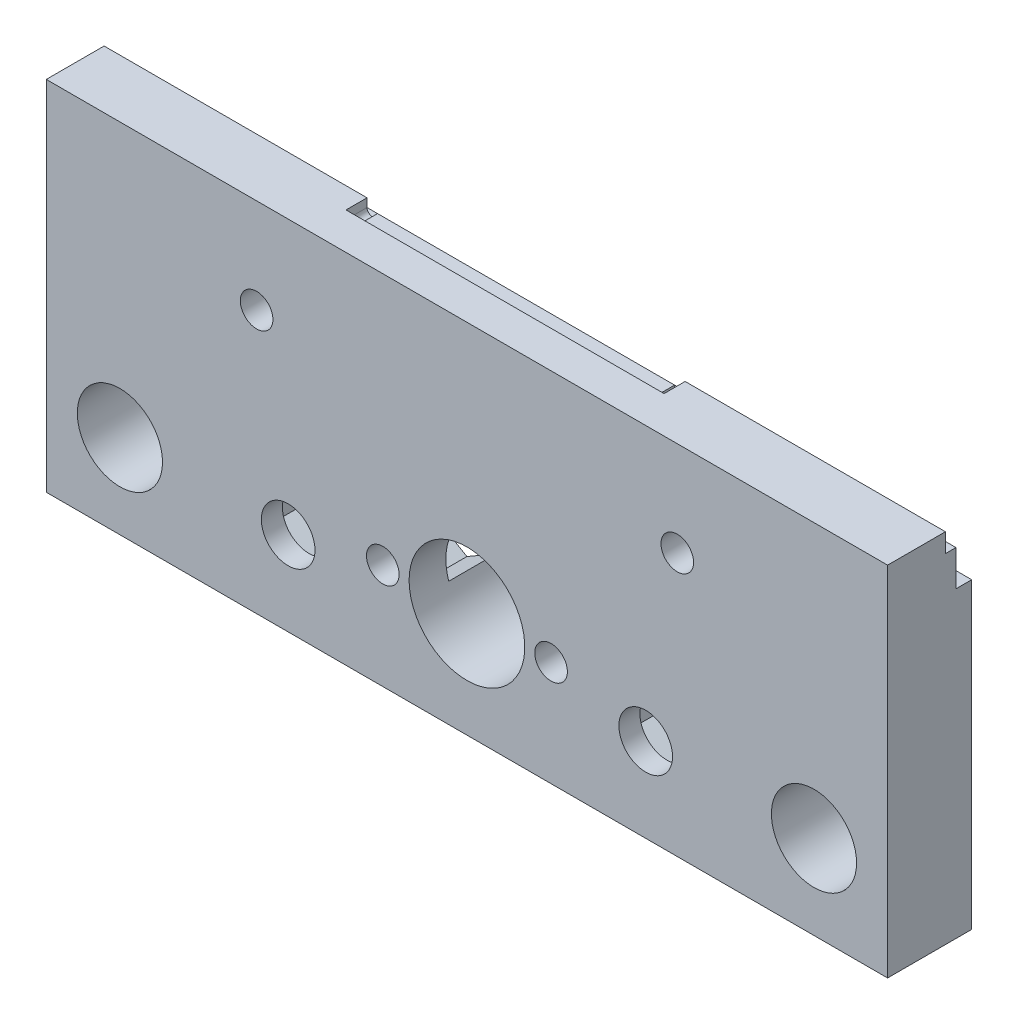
ISO-10303-21;
HEADER;
FILE_DESCRIPTION(('STEP AP214'),'2;1');
FILE_NAME('part.step','',(''),(''),'','','');
FILE_SCHEMA(('AUTOMOTIVE_DESIGN { 1 0 10303 214 1 1 1 1 }'));
ENDSEC;
DATA;
#1=APPLICATION_CONTEXT('core data for automotive mechanical design processes');
#2=APPLICATION_PROTOCOL_DEFINITION('international standard','automotive_design',2000,#1);
#3=PRODUCT_CONTEXT('',#1,'mechanical');
#4=PRODUCT('Part','Part','',(#3));
#5=PRODUCT_RELATED_PRODUCT_CATEGORY('part','',(#4));
#6=PRODUCT_DEFINITION_FORMATION('','',#4);
#7=PRODUCT_DEFINITION_CONTEXT('part definition',#1,'design');
#8=PRODUCT_DEFINITION('design','',#6,#7);
#9=PRODUCT_DEFINITION_SHAPE('','',#8);
#10=(LENGTH_UNIT() NAMED_UNIT(*) SI_UNIT(.MILLI.,.METRE.));
#11=(NAMED_UNIT(*) PLANE_ANGLE_UNIT() SI_UNIT($,.RADIAN.));
#12=(NAMED_UNIT(*) SI_UNIT($,.STERADIAN.) SOLID_ANGLE_UNIT());
#13=UNCERTAINTY_MEASURE_WITH_UNIT(LENGTH_MEASURE(1.E-05),#10,'distance_accuracy_value','');
#14=(GEOMETRIC_REPRESENTATION_CONTEXT(3) GLOBAL_UNCERTAINTY_ASSIGNED_CONTEXT((#13)) GLOBAL_UNIT_ASSIGNED_CONTEXT((#10,
#11,#12)) REPRESENTATION_CONTEXT('',''));
#15=CARTESIAN_POINT('',(0.,0.,0.));
#16=DIRECTION('',(0.,0.,1.));
#17=DIRECTION('',(1.,0.,0.));
#18=AXIS2_PLACEMENT_3D('',#15,#16,#17);
#19=CARTESIAN_POINT('',(57.,8.,0.));
#20=DIRECTION('',(0.,0.,1.));
#21=DIRECTION('',(1.,0.,0.));
#22=AXIS2_PLACEMENT_3D('',#19,#20,#21);
#23=CYLINDRICAL_SURFACE('',#22,2.55);
#24=CARTESIAN_POINT('',(57.,8.,8.));
#25=DIRECTION('',(0.,0.,1.));
#26=DIRECTION('',(1.,0.,0.));
#27=AXIS2_PLACEMENT_3D('',#24,#25,#26);
#28=CIRCLE('',#27,2.55);
#29=CARTESIAN_POINT('',(59.55,8.,8.));
#30=VERTEX_POINT('',#29);
#31=EDGE_CURVE('E351',#30,#30,#28,.T.);
#32=ORIENTED_EDGE('',*,*,#31,.T.);
#33=EDGE_LOOP('',(#32));
#34=FACE_BOUND('',#33,.T.);
#35=CARTESIAN_POINT('',(57.,8.,6.));
#36=DIRECTION('',(0.,0.,-1.));
#37=DIRECTION('',(-1.,0.,0.));
#38=AXIS2_PLACEMENT_3D('',#35,#36,#37);
#39=CIRCLE('',#38,2.55);
#40=CARTESIAN_POINT('',(54.45,8.,6.));
#41=VERTEX_POINT('',#40);
#42=EDGE_CURVE('E413',#41,#41,#39,.F.);
#43=ORIENTED_EDGE('',*,*,#42,.F.);
#44=EDGE_LOOP('',(#43));
#45=FACE_BOUND('',#44,.T.);
#46=ADVANCED_FACE('F33',(#34,#45),#23,.F.);
#47=CARTESIAN_POINT('',(23.,8.,0.));
#48=DIRECTION('',(0.,0.,1.));
#49=DIRECTION('',(1.,0.,0.));
#50=AXIS2_PLACEMENT_3D('',#47,#48,#49);
#51=CYLINDRICAL_SURFACE('',#50,2.55);
#52=CARTESIAN_POINT('',(23.,8.,8.));
#53=DIRECTION('',(0.,0.,1.));
#54=DIRECTION('',(1.,0.,0.));
#55=AXIS2_PLACEMENT_3D('',#52,#53,#54);
#56=CIRCLE('',#55,2.55);
#57=CARTESIAN_POINT('',(25.55,8.,8.));
#58=VERTEX_POINT('',#57);
#59=EDGE_CURVE('E361',#58,#58,#56,.T.);
#60=ORIENTED_EDGE('',*,*,#59,.T.);
#61=EDGE_LOOP('',(#60));
#62=FACE_BOUND('',#61,.T.);
#63=CARTESIAN_POINT('',(23.,8.,6.));
#64=DIRECTION('',(0.,0.,-1.));
#65=DIRECTION('',(-1.,0.,0.));
#66=AXIS2_PLACEMENT_3D('',#63,#64,#65);
#67=CIRCLE('',#66,2.55);
#68=CARTESIAN_POINT('',(20.45,8.,6.));
#69=VERTEX_POINT('',#68);
#70=EDGE_CURVE('E411',#69,#69,#67,.F.);
#71=ORIENTED_EDGE('',*,*,#70,.F.);
#72=EDGE_LOOP('',(#71));
#73=FACE_BOUND('',#72,.T.);
#74=ADVANCED_FACE('F703',(#62,#73),#51,.F.);
#75=CARTESIAN_POINT('',(32.,10.,0.));
#76=DIRECTION('',(0.,0.,1.));
#77=DIRECTION('',(1.,0.,0.));
#78=AXIS2_PLACEMENT_3D('',#75,#76,#77);
#79=CYLINDRICAL_SURFACE('',#78,1.55);
#80=CARTESIAN_POINT('',(32.,10.,8.));
#81=DIRECTION('',(0.,0.,1.));
#82=DIRECTION('',(1.,0.,0.));
#83=AXIS2_PLACEMENT_3D('',#80,#81,#82);
#84=CIRCLE('',#83,1.55);
#85=CARTESIAN_POINT('',(33.55,10.,8.));
#86=VERTEX_POINT('',#85);
#87=EDGE_CURVE('E321',#86,#86,#84,.T.);
#88=ORIENTED_EDGE('',*,*,#87,.T.);
#89=EDGE_LOOP('',(#88));
#90=FACE_BOUND('',#89,.T.);
#91=CARTESIAN_POINT('',(32.,10.,4.5));
#92=DIRECTION('',(0.,0.,-1.));
#93=DIRECTION('',(-1.,0.,0.));
#94=AXIS2_PLACEMENT_3D('',#91,#92,#93);
#95=CIRCLE('',#94,1.55);
#96=CARTESIAN_POINT('',(30.45,10.,4.5));
#97=VERTEX_POINT('',#96);
#98=EDGE_CURVE('E324',#97,#97,#95,.F.);
#99=ORIENTED_EDGE('',*,*,#98,.F.);
#100=EDGE_LOOP('',(#99));
#101=FACE_BOUND('',#100,.T.);
#102=ADVANCED_FACE('F709',(#90,#101),#79,.F.);
#103=CARTESIAN_POINT('',(48.,10.,0.));
#104=DIRECTION('',(0.,0.,1.));
#105=DIRECTION('',(1.,0.,0.));
#106=AXIS2_PLACEMENT_3D('',#103,#104,#105);
#107=CYLINDRICAL_SURFACE('',#106,1.55);
#108=CARTESIAN_POINT('',(48.,10.,8.));
#109=DIRECTION('',(0.,0.,1.));
#110=DIRECTION('',(1.,0.,0.));
#111=AXIS2_PLACEMENT_3D('',#108,#109,#110);
#112=CIRCLE('',#111,1.55);
#113=CARTESIAN_POINT('',(49.55,10.,8.));
#114=VERTEX_POINT('',#113);
#115=EDGE_CURVE('E317',#114,#114,#112,.T.);
#116=ORIENTED_EDGE('',*,*,#115,.T.);
#117=EDGE_LOOP('',(#116));
#118=FACE_BOUND('',#117,.T.);
#119=CARTESIAN_POINT('',(48.,10.,4.5));
#120=DIRECTION('',(0.,0.,-1.));
#121=DIRECTION('',(-1.,0.,0.));
#122=AXIS2_PLACEMENT_3D('',#119,#120,#121);
#123=CIRCLE('',#122,1.55);
#124=CARTESIAN_POINT('',(46.45,10.,4.5));
#125=VERTEX_POINT('',#124);
#126=EDGE_CURVE('E405',#125,#125,#123,.F.);
#127=ORIENTED_EDGE('',*,*,#126,.F.);
#128=EDGE_LOOP('',(#127));
#129=FACE_BOUND('',#128,.T.);
#130=ADVANCED_FACE('F726',(#118,#129),#107,.F.);
#131=CARTESIAN_POINT('',(0.,0.,8.));
#132=DIRECTION('',(0.,0.,1.));
#133=DIRECTION('',(1.,0.,0.));
#134=AXIS2_PLACEMENT_3D('',#131,#132,#133);
#135=PLANE('',#134);
#136=CARTESIAN_POINT('',(40.,10.,8.));
#137=DIRECTION('',(0.,0.,-1.));
#138=DIRECTION('',(-1.,0.,0.));
#139=AXIS2_PLACEMENT_3D('',#136,#137,#138);
#140=CIRCLE('',#139,5.5);
#141=CARTESIAN_POINT('',(34.5,10.,8.));
#142=VERTEX_POINT('',#141);
#143=EDGE_CURVE('E291',#142,#142,#140,.T.);
#144=ORIENTED_EDGE('',*,*,#143,.T.);
#145=EDGE_LOOP('',(#144));
#146=FACE_BOUND('',#145,.T.);
#147=CARTESIAN_POINT('',(60.,25.,8.));
#148=DIRECTION('',(0.,0.,-1.));
#149=DIRECTION('',(-1.,0.,0.));
#150=AXIS2_PLACEMENT_3D('',#147,#148,#149);
#151=CIRCLE('',#150,1.55000000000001);
#152=CARTESIAN_POINT('',(58.45,25.,8.));
#153=VERTEX_POINT('',#152);
#154=EDGE_CURVE('E453',#153,#153,#151,.T.);
#155=ORIENTED_EDGE('',*,*,#154,.T.);
#156=EDGE_LOOP('',(#155));
#157=FACE_BOUND('',#156,.T.);
#158=CARTESIAN_POINT('',(20.,25.,8.));
#159=DIRECTION('',(0.,0.,-1.));
#160=DIRECTION('',(-1.,0.,0.));
#161=AXIS2_PLACEMENT_3D('',#158,#159,#160);
#162=CIRCLE('',#161,1.55);
#163=CARTESIAN_POINT('',(18.45,25.,8.));
#164=VERTEX_POINT('',#163);
#165=EDGE_CURVE('E460',#164,#164,#162,.T.);
#166=ORIENTED_EDGE('',*,*,#165,.T.);
#167=EDGE_LOOP('',(#166));
#168=FACE_BOUND('',#167,.T.);
#169=ORIENTED_EDGE('',*,*,#115,.F.);
#170=EDGE_LOOP('',(#169));
#171=FACE_BOUND('',#170,.T.);
#172=ORIENTED_EDGE('',*,*,#87,.F.);
#173=EDGE_LOOP('',(#172));
#174=FACE_BOUND('',#173,.T.);
#175=ORIENTED_EDGE('',*,*,#59,.F.);
#176=EDGE_LOOP('',(#175));
#177=FACE_BOUND('',#176,.T.);
#178=ORIENTED_EDGE('',*,*,#31,.F.);
#179=EDGE_LOOP('',(#178));
#180=FACE_BOUND('',#179,.T.);
#181=DIRECTION('',(0.,-1.,0.));
#182=VECTOR('',#181,1.);
#183=CARTESIAN_POINT('',(0.,34.,8.));
#184=LINE('',#183,#182);
#185=CARTESIAN_POINT('',(0.,34.,8.));
#186=VERTEX_POINT('',#185);
#187=CARTESIAN_POINT('',(0.,0.,8.));
#188=VERTEX_POINT('',#187);
#189=EDGE_CURVE('E379',#186,#188,#184,.T.);
#190=ORIENTED_EDGE('',*,*,#189,.T.);
#191=DIRECTION('',(1.,0.,0.));
#192=VECTOR('',#191,1.);
#193=CARTESIAN_POINT('',(0.,0.,8.));
#194=LINE('',#193,#192);
#195=CARTESIAN_POINT('',(80.,0.,8.));
#196=VERTEX_POINT('',#195);
#197=EDGE_CURVE('E382',#188,#196,#194,.T.);
#198=ORIENTED_EDGE('',*,*,#197,.T.);
#199=DIRECTION('',(0.,1.,0.));
#200=VECTOR('',#199,1.);
#201=CARTESIAN_POINT('',(80.,0.,8.));
#202=LINE('',#201,#200);
#203=CARTESIAN_POINT('',(80.,34.,8.));
#204=VERTEX_POINT('',#203);
#205=EDGE_CURVE('E385',#196,#204,#202,.T.);
#206=ORIENTED_EDGE('',*,*,#205,.T.);
#207=DIRECTION('',(-1.,0.,0.));
#208=VECTOR('',#207,1.);
#209=CARTESIAN_POINT('',(80.,34.,8.));
#210=LINE('',#209,#208);
#211=EDGE_CURVE('E387',#204,#186,#210,.T.);
#212=ORIENTED_EDGE('',*,*,#211,.T.);
#213=EDGE_LOOP('',(#190,#198,#206,#212));
#214=FACE_BOUND('',#213,.T.);
#215=CARTESIAN_POINT('',(7.,8.,8.));
#216=DIRECTION('',(0.,0.,1.));
#217=DIRECTION('',(1.,0.,0.));
#218=AXIS2_PLACEMENT_3D('',#215,#216,#217);
#219=CIRCLE('',#218,4.05);
#220=CARTESIAN_POINT('',(11.05,8.,8.));
#221=VERTEX_POINT('',#220);
#222=EDGE_CURVE('E373',#221,#221,#219,.T.);
#223=ORIENTED_EDGE('',*,*,#222,.F.);
#224=EDGE_LOOP('',(#223));
#225=FACE_BOUND('',#224,.T.);
#226=CARTESIAN_POINT('',(73.,8.,8.));
#227=DIRECTION('',(0.,0.,1.));
#228=DIRECTION('',(1.,0.,0.));
#229=AXIS2_PLACEMENT_3D('',#226,#227,#228);
#230=CIRCLE('',#229,4.05);
#231=CARTESIAN_POINT('',(77.05,8.,8.));
#232=VERTEX_POINT('',#231);
#233=EDGE_CURVE('E367',#232,#232,#230,.T.);
#234=ORIENTED_EDGE('',*,*,#233,.F.);
#235=EDGE_LOOP('',(#234));
#236=FACE_BOUND('',#235,.T.);
#237=ADVANCED_FACE('F675',(#146,#157,#168,#171,#174,#177,#180,#214,#225,#236),#135,.T.);
#238=CARTESIAN_POINT('',(0.,0.,0.));
#239=DIRECTION('',(0.,0.,1.));
#240=DIRECTION('',(1.,0.,0.));
#241=AXIS2_PLACEMENT_3D('',#238,#239,#240);
#242=PLANE('',#241);
#243=DIRECTION('',(0.,1.,0.));
#244=VECTOR('',#243,1.);
#245=CARTESIAN_POINT('',(52.9,5.63286389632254,0.));
#246=LINE('',#245,#244);
#247=CARTESIAN_POINT('',(52.9,5.63286389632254,0.));
#248=VERTEX_POINT('',#247);
#249=CARTESIAN_POINT('',(52.9,10.3671361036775,0.));
#250=VERTEX_POINT('',#249);
#251=EDGE_CURVE('E566',#248,#250,#246,.T.);
#252=ORIENTED_EDGE('',*,*,#251,.F.);
#253=DIRECTION('',(-0.866025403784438,0.5,0.));
#254=VECTOR('',#253,1.);
#255=CARTESIAN_POINT('',(57.,3.26572779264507,0.));
#256=LINE('',#255,#254);
#257=CARTESIAN_POINT('',(57.,3.26572779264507,0.));
#258=VERTEX_POINT('',#257);
#259=EDGE_CURVE('E55',#258,#248,#256,.T.);
#260=ORIENTED_EDGE('',*,*,#259,.F.);
#261=DIRECTION('',(-0.866025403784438,-0.5,0.));
#262=VECTOR('',#261,1.);
#263=CARTESIAN_POINT('',(61.1,5.63286389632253,0.));
#264=LINE('',#263,#262);
#265=CARTESIAN_POINT('',(61.1,5.63286389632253,0.));
#266=VERTEX_POINT('',#265);
#267=EDGE_CURVE('E549',#266,#258,#264,.T.);
#268=ORIENTED_EDGE('',*,*,#267,.F.);
#269=DIRECTION('',(0.,-1.,0.));
#270=VECTOR('',#269,1.);
#271=CARTESIAN_POINT('',(61.1,10.3671361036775,0.));
#272=LINE('',#271,#270);
#273=CARTESIAN_POINT('',(61.1,10.3671361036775,0.));
#274=VERTEX_POINT('',#273);
#275=EDGE_CURVE('E576',#274,#266,#272,.T.);
#276=ORIENTED_EDGE('',*,*,#275,.F.);
#277=DIRECTION('',(0.866025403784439,-0.5,0.));
#278=VECTOR('',#277,1.);
#279=CARTESIAN_POINT('',(57.,12.7342722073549,0.));
#280=LINE('',#279,#278);
#281=CARTESIAN_POINT('',(57.,12.7342722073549,0.));
#282=VERTEX_POINT('',#281);
#283=EDGE_CURVE('E573',#282,#274,#280,.T.);
#284=ORIENTED_EDGE('',*,*,#283,.F.);
#285=DIRECTION('',(0.866025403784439,0.5,0.));
#286=VECTOR('',#285,1.);
#287=CARTESIAN_POINT('',(52.9,10.3671361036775,0.));
#288=LINE('',#287,#286);
#289=EDGE_CURVE('E570',#250,#282,#288,.T.);
#290=ORIENTED_EDGE('',*,*,#289,.F.);
#291=EDGE_LOOP('',(#252,#260,#268,#276,#284,#290));
#292=FACE_BOUND('',#291,.T.);
#293=DIRECTION('',(0.,1.,0.));
#294=VECTOR('',#293,1.);
#295=CARTESIAN_POINT('',(18.9,5.63286389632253,0.));
#296=LINE('',#295,#294);
#297=CARTESIAN_POINT('',(18.9,5.63286389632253,0.));
#298=VERTEX_POINT('',#297);
#299=CARTESIAN_POINT('',(18.9,10.3671361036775,0.));
#300=VERTEX_POINT('',#299);
#301=EDGE_CURVE('E612',#298,#300,#296,.T.);
#302=ORIENTED_EDGE('',*,*,#301,.F.);
#303=DIRECTION('',(-0.866025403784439,0.499999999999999,0.));
#304=VECTOR('',#303,1.);
#305=CARTESIAN_POINT('',(23.,3.26572779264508,0.));
#306=LINE('',#305,#304);
#307=CARTESIAN_POINT('',(23.,3.26572779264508,0.));
#308=VERTEX_POINT('',#307);
#309=EDGE_CURVE('E544',#308,#298,#306,.T.);
#310=ORIENTED_EDGE('',*,*,#309,.F.);
#311=DIRECTION('',(-0.866025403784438,-0.5,0.));
#312=VECTOR('',#311,1.);
#313=CARTESIAN_POINT('',(27.1,5.63286389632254,0.));
#314=LINE('',#313,#312);
#315=CARTESIAN_POINT('',(27.1,5.63286389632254,0.));
#316=VERTEX_POINT('',#315);
#317=EDGE_CURVE('E595',#316,#308,#314,.T.);
#318=ORIENTED_EDGE('',*,*,#317,.F.);
#319=DIRECTION('',(0.,-1.,0.));
#320=VECTOR('',#319,1.);
#321=CARTESIAN_POINT('',(27.1,10.3671361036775,0.));
#322=LINE('',#321,#320);
#323=CARTESIAN_POINT('',(27.1,10.3671361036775,0.));
#324=VERTEX_POINT('',#323);
#325=EDGE_CURVE('E621',#324,#316,#322,.T.);
#326=ORIENTED_EDGE('',*,*,#325,.F.);
#327=DIRECTION('',(0.866025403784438,-0.5,0.));
#328=VECTOR('',#327,1.);
#329=CARTESIAN_POINT('',(23.,12.7342722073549,0.));
#330=LINE('',#329,#328);
#331=CARTESIAN_POINT('',(23.,12.7342722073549,0.));
#332=VERTEX_POINT('',#331);
#333=EDGE_CURVE('E618',#332,#324,#330,.T.);
#334=ORIENTED_EDGE('',*,*,#333,.F.);
#335=DIRECTION('',(0.866025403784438,0.500000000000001,0.));
#336=VECTOR('',#335,1.);
#337=CARTESIAN_POINT('',(18.9,10.3671361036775,0.));
#338=LINE('',#337,#336);
#339=EDGE_CURVE('E615',#300,#332,#338,.T.);
#340=ORIENTED_EDGE('',*,*,#339,.F.);
#341=EDGE_LOOP('',(#302,#310,#318,#326,#334,#340));
#342=FACE_BOUND('',#341,.T.);
#343=CARTESIAN_POINT('',(60.,25.,0.));
#344=DIRECTION('',(0.,0.,-1.));
#345=DIRECTION('',(-1.,0.,0.));
#346=AXIS2_PLACEMENT_3D('',#343,#344,#345);
#347=CIRCLE('',#346,1.55000000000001);
#348=CARTESIAN_POINT('',(58.45,25.,0.));
#349=VERTEX_POINT('',#348);
#350=EDGE_CURVE('E457',#349,#349,#347,.T.);
#351=ORIENTED_EDGE('',*,*,#350,.F.);
#352=EDGE_LOOP('',(#351));
#353=FACE_BOUND('',#352,.T.);
#354=CARTESIAN_POINT('',(20.,25.,0.));
#355=DIRECTION('',(0.,0.,-1.));
#356=DIRECTION('',(-1.,0.,0.));
#357=AXIS2_PLACEMENT_3D('',#354,#355,#356);
#358=CIRCLE('',#357,1.55);
#359=CARTESIAN_POINT('',(18.45,25.,0.));
#360=VERTEX_POINT('',#359);
#361=EDGE_CURVE('E442',#360,#360,#358,.T.);
#362=ORIENTED_EDGE('',*,*,#361,.F.);
#363=EDGE_LOOP('',(#362));
#364=FACE_BOUND('',#363,.T.);
#365=DIRECTION('',(0.866025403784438,0.5,0.));
#366=VECTOR('',#365,1.);
#367=CARTESIAN_POINT('',(45.15,11.6454482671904,0.));
#368=LINE('',#367,#366);
#369=CARTESIAN_POINT('',(45.2328562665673,11.6932853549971,0.));
#370=VERTEX_POINT('',#369);
#371=CARTESIAN_POINT('',(48.,13.2908965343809,0.));
#372=VERTEX_POINT('',#371);
#373=EDGE_CURVE('E290',#370,#372,#368,.T.);
#374=ORIENTED_EDGE('',*,*,#373,.F.);
#375=CARTESIAN_POINT('',(40.,10.,0.));
#376=DIRECTION('',(0.,0.,-1.));
#377=DIRECTION('',(-1.,0.,0.));
#378=AXIS2_PLACEMENT_3D('',#375,#376,#377);
#379=CIRCLE('',#378,5.5);
#380=CARTESIAN_POINT('',(34.7671437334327,11.6932853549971,0.));
#381=VERTEX_POINT('',#380);
#382=EDGE_CURVE('E276',#381,#370,#379,.T.);
#383=ORIENTED_EDGE('',*,*,#382,.F.);
#384=DIRECTION('',(0.866025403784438,-0.500000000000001,0.));
#385=VECTOR('',#384,1.);
#386=CARTESIAN_POINT('',(32.,13.2908965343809,0.));
#387=LINE('',#386,#385);
#388=CARTESIAN_POINT('',(32.,13.2908965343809,0.));
#389=VERTEX_POINT('',#388);
#390=EDGE_CURVE('E288',#389,#381,#387,.T.);
#391=ORIENTED_EDGE('',*,*,#390,.F.);
#392=DIRECTION('',(0.866025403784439,0.5,0.));
#393=VECTOR('',#392,1.);
#394=CARTESIAN_POINT('',(29.15,11.6454482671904,0.));
#395=LINE('',#394,#393);
#396=CARTESIAN_POINT('',(29.15,11.6454482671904,0.));
#397=VERTEX_POINT('',#396);
#398=EDGE_CURVE('E298',#397,#389,#395,.T.);
#399=ORIENTED_EDGE('',*,*,#398,.F.);
#400=DIRECTION('',(0.,1.,0.));
#401=VECTOR('',#400,1.);
#402=CARTESIAN_POINT('',(29.15,8.35455173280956,0.));
#403=LINE('',#402,#401);
#404=CARTESIAN_POINT('',(29.15,8.35455173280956,0.));
#405=VERTEX_POINT('',#404);
#406=EDGE_CURVE('E302',#405,#397,#403,.T.);
#407=ORIENTED_EDGE('',*,*,#406,.F.);
#408=DIRECTION('',(-0.866025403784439,0.499999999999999,0.));
#409=VECTOR('',#408,1.);
#410=CARTESIAN_POINT('',(32.,6.70910346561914,0.));
#411=LINE('',#410,#409);
#412=CARTESIAN_POINT('',(32.,6.70910346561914,0.));
#413=VERTEX_POINT('',#412);
#414=EDGE_CURVE('E456',#413,#405,#411,.T.);
#415=ORIENTED_EDGE('',*,*,#414,.F.);
#416=DIRECTION('',(-0.866025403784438,-0.500000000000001,0.));
#417=VECTOR('',#416,1.);
#418=CARTESIAN_POINT('',(34.85,8.35455173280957,0.));
#419=LINE('',#418,#417);
#420=CARTESIAN_POINT('',(34.7671437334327,8.30671464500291,0.));
#421=VERTEX_POINT('',#420);
#422=EDGE_CURVE('E297',#421,#413,#419,.T.);
#423=ORIENTED_EDGE('',*,*,#422,.F.);
#424=CARTESIAN_POINT('',(45.2328562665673,8.30671464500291,0.));
#425=VERTEX_POINT('',#424);
#426=EDGE_CURVE('E292',#425,#421,#379,.T.);
#427=ORIENTED_EDGE('',*,*,#426,.F.);
#428=DIRECTION('',(-0.866025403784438,0.5,0.));
#429=VECTOR('',#428,1.);
#430=CARTESIAN_POINT('',(48.,6.70910346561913,0.));
#431=LINE('',#430,#429);
#432=CARTESIAN_POINT('',(48.,6.70910346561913,0.));
#433=VERTEX_POINT('',#432);
#434=EDGE_CURVE('E309',#433,#425,#431,.T.);
#435=ORIENTED_EDGE('',*,*,#434,.F.);
#436=DIRECTION('',(-0.866025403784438,-0.5,0.));
#437=VECTOR('',#436,1.);
#438=CARTESIAN_POINT('',(50.85,8.35455173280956,0.));
#439=LINE('',#438,#437);
#440=CARTESIAN_POINT('',(50.85,8.35455173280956,0.));
#441=VERTEX_POINT('',#440);
#442=EDGE_CURVE('E469',#441,#433,#439,.T.);
#443=ORIENTED_EDGE('',*,*,#442,.F.);
#444=DIRECTION('',(0.,-1.,0.));
#445=VECTOR('',#444,1.);
#446=CARTESIAN_POINT('',(50.85,11.6454482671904,0.));
#447=LINE('',#446,#445);
#448=CARTESIAN_POINT('',(50.85,11.6454482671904,0.));
#449=VERTEX_POINT('',#448);
#450=EDGE_CURVE('E487',#449,#441,#447,.T.);
#451=ORIENTED_EDGE('',*,*,#450,.F.);
#452=DIRECTION('',(0.866025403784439,-0.5,0.));
#453=VECTOR('',#452,1.);
#454=CARTESIAN_POINT('',(48.,13.2908965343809,0.));
#455=LINE('',#454,#453);
#456=EDGE_CURVE('E484',#372,#449,#455,.T.);
#457=ORIENTED_EDGE('',*,*,#456,.F.);
#458=EDGE_LOOP('',(#374,#383,#391,#399,#407,#415,#423,#427,#435,#443,#451,#457));
#459=FACE_BOUND('',#458,.T.);
#460=DIRECTION('',(0.,-1.,0.));
#461=VECTOR('',#460,1.);
#462=CARTESIAN_POINT('',(0.,34.,0.));
#463=LINE('',#462,#461);
#464=CARTESIAN_POINT('',(0.,28.7999999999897,0.));
#465=VERTEX_POINT('',#464);
#466=CARTESIAN_POINT('',(0.,0.,0.));
#467=VERTEX_POINT('',#466);
#468=EDGE_CURVE('E376',#465,#467,#463,.T.);
#469=ORIENTED_EDGE('',*,*,#468,.F.);
#470=DIRECTION('',(1.,0.,0.));
#471=VECTOR('',#470,1.);
#472=CARTESIAN_POINT('',(0.,28.7999999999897,0.));
#473=LINE('',#472,#471);
#474=CARTESIAN_POINT('',(80.,28.7999999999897,0.));
#475=VERTEX_POINT('',#474);
#476=EDGE_CURVE('E348',#465,#475,#473,.T.);
#477=ORIENTED_EDGE('',*,*,#476,.T.);
#478=DIRECTION('',(0.,1.,0.));
#479=VECTOR('',#478,1.);
#480=CARTESIAN_POINT('',(80.,0.,0.));
#481=LINE('',#480,#479);
#482=CARTESIAN_POINT('',(80.,0.,0.));
#483=VERTEX_POINT('',#482);
#484=EDGE_CURVE('E383',#483,#475,#481,.T.);
#485=ORIENTED_EDGE('',*,*,#484,.F.);
#486=DIRECTION('',(1.,0.,0.));
#487=VECTOR('',#486,1.);
#488=CARTESIAN_POINT('',(0.,0.,0.));
#489=LINE('',#488,#487);
#490=EDGE_CURVE('E391',#467,#483,#489,.T.);
#491=ORIENTED_EDGE('',*,*,#490,.F.);
#492=EDGE_LOOP('',(#469,#477,#485,#491));
#493=FACE_BOUND('',#492,.T.);
#494=CARTESIAN_POINT('',(7.,8.,0.));
#495=DIRECTION('',(0.,0.,1.));
#496=DIRECTION('',(1.,0.,0.));
#497=AXIS2_PLACEMENT_3D('',#494,#495,#496);
#498=CIRCLE('',#497,4.05);
#499=CARTESIAN_POINT('',(11.05,8.,0.));
#500=VERTEX_POINT('',#499);
#501=EDGE_CURVE('E370',#500,#500,#498,.T.);
#502=ORIENTED_EDGE('',*,*,#501,.T.);
#503=EDGE_LOOP('',(#502));
#504=FACE_BOUND('',#503,.T.);
#505=CARTESIAN_POINT('',(73.,8.,0.));
#506=DIRECTION('',(0.,0.,1.));
#507=DIRECTION('',(1.,0.,0.));
#508=AXIS2_PLACEMENT_3D('',#505,#506,#507);
#509=CIRCLE('',#508,4.05);
#510=CARTESIAN_POINT('',(77.05,8.,0.));
#511=VERTEX_POINT('',#510);
#512=EDGE_CURVE('E364',#511,#511,#509,.T.);
#513=ORIENTED_EDGE('',*,*,#512,.T.);
#514=EDGE_LOOP('',(#513));
#515=FACE_BOUND('',#514,.T.);
#516=ADVANCED_FACE('F285',(#292,#342,#353,#364,#459,#493,#504,#515),#242,.F.);
#517=CARTESIAN_POINT('',(0.,34.,8.));
#518=DIRECTION('',(1.,0.,0.));
#519=DIRECTION('',(0.,0.,-1.));
#520=AXIS2_PLACEMENT_3D('',#517,#518,#519);
#521=PLANE('',#520);
#522=DIRECTION('',(0.,-1.,0.));
#523=VECTOR('',#522,1.);
#524=CARTESIAN_POINT('',(0.,32.2,1.5));
#525=LINE('',#524,#523);
#526=CARTESIAN_POINT('',(0.,32.2,1.5));
#527=VERTEX_POINT('',#526);
#528=CARTESIAN_POINT('',(0.,28.8,1.5));
#529=VERTEX_POINT('',#528);
#530=EDGE_CURVE('E332',#527,#529,#525,.T.);
#531=ORIENTED_EDGE('',*,*,#530,.T.);
#532=DIRECTION('',(0.,-6.85562717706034E-12,-1.));
#533=VECTOR('',#532,1.);
#534=CARTESIAN_POINT('',(0.,28.8,1.5));
#535=LINE('',#534,#533);
#536=EDGE_CURVE('E335',#529,#465,#535,.T.);
#537=ORIENTED_EDGE('',*,*,#536,.T.);
#538=ORIENTED_EDGE('',*,*,#468,.T.);
#539=DIRECTION('',(0.,0.,-1.));
#540=VECTOR('',#539,1.);
#541=CARTESIAN_POINT('',(0.,0.,8.));
#542=LINE('',#541,#540);
#543=EDGE_CURVE('E41',#188,#467,#542,.T.);
#544=ORIENTED_EDGE('',*,*,#543,.F.);
#545=ORIENTED_EDGE('',*,*,#189,.F.);
#546=DIRECTION('',(0.,0.,-1.));
#547=VECTOR('',#546,1.);
#548=CARTESIAN_POINT('',(0.,34.,8.));
#549=LINE('',#548,#547);
#550=CARTESIAN_POINT('',(0.,34.,2.5));
#551=VERTEX_POINT('',#550);
#552=EDGE_CURVE('E389',#186,#551,#549,.T.);
#553=ORIENTED_EDGE('',*,*,#552,.T.);
#554=DIRECTION('',(0.,-1.,0.));
#555=VECTOR('',#554,1.);
#556=CARTESIAN_POINT('',(0.,32.2,2.5));
#557=LINE('',#556,#555);
#558=CARTESIAN_POINT('',(0.,32.2,2.5));
#559=VERTEX_POINT('',#558);
#560=EDGE_CURVE('E325',#551,#559,#557,.T.);
#561=ORIENTED_EDGE('',*,*,#560,.T.);
#562=DIRECTION('',(0.,0.,-1.));
#563=VECTOR('',#562,1.);
#564=CARTESIAN_POINT('',(0.,32.2,1.5));
#565=LINE('',#564,#563);
#566=EDGE_CURVE('E328',#559,#527,#565,.T.);
#567=ORIENTED_EDGE('',*,*,#566,.T.);
#568=EDGE_LOOP('',(#531,#537,#538,#544,#545,#553,#561,#567));
#569=FACE_BOUND('',#568,.T.);
#570=ADVANCED_FACE('F35',(#569),#521,.F.);
#571=CARTESIAN_POINT('',(0.,0.,8.));
#572=DIRECTION('',(0.,1.,0.));
#573=DIRECTION('',(0.,0.,1.));
#574=AXIS2_PLACEMENT_3D('',#571,#572,#573);
#575=PLANE('',#574);
#576=ORIENTED_EDGE('',*,*,#490,.T.);
#577=DIRECTION('',(0.,0.,-1.));
#578=VECTOR('',#577,1.);
#579=CARTESIAN_POINT('',(80.,0.,8.));
#580=LINE('',#579,#578);
#581=EDGE_CURVE('E400',#196,#483,#580,.T.);
#582=ORIENTED_EDGE('',*,*,#581,.F.);
#583=ORIENTED_EDGE('',*,*,#197,.F.);
#584=ORIENTED_EDGE('',*,*,#543,.T.);
#585=EDGE_LOOP('',(#576,#582,#583,#584));
#586=FACE_BOUND('',#585,.T.);
#587=ADVANCED_FACE('F734',(#586),#575,.F.);
#588=CARTESIAN_POINT('',(80.,0.,8.));
#589=DIRECTION('',(-1.,0.,0.));
#590=DIRECTION('',(0.,0.,1.));
#591=AXIS2_PLACEMENT_3D('',#588,#589,#590);
#592=PLANE('',#591);
#593=ORIENTED_EDGE('',*,*,#484,.T.);
#594=DIRECTION('',(0.,-6.85562717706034E-12,-1.));
#595=VECTOR('',#594,1.);
#596=CARTESIAN_POINT('',(80.,28.8,1.5));
#597=LINE('',#596,#595);
#598=CARTESIAN_POINT('',(80.,28.8,1.5));
#599=VERTEX_POINT('',#598);
#600=EDGE_CURVE('E329',#599,#475,#597,.T.);
#601=ORIENTED_EDGE('',*,*,#600,.F.);
#602=DIRECTION('',(0.,-1.,0.));
#603=VECTOR('',#602,1.);
#604=CARTESIAN_POINT('',(80.,32.2,1.5));
#605=LINE('',#604,#603);
#606=CARTESIAN_POINT('',(80.,32.2,1.5));
#607=VERTEX_POINT('',#606);
#608=EDGE_CURVE('E344',#607,#599,#605,.T.);
#609=ORIENTED_EDGE('',*,*,#608,.F.);
#610=DIRECTION('',(0.,0.,-1.));
#611=VECTOR('',#610,1.);
#612=CARTESIAN_POINT('',(80.,32.2,1.5));
#613=LINE('',#612,#611);
#614=CARTESIAN_POINT('',(80.,32.2,2.5));
#615=VERTEX_POINT('',#614);
#616=EDGE_CURVE('E341',#615,#607,#613,.T.);
#617=ORIENTED_EDGE('',*,*,#616,.F.);
#618=DIRECTION('',(0.,-1.,0.));
#619=VECTOR('',#618,1.);
#620=CARTESIAN_POINT('',(80.,32.2,2.5));
#621=LINE('',#620,#619);
#622=CARTESIAN_POINT('',(80.,34.,2.5));
#623=VERTEX_POINT('',#622);
#624=EDGE_CURVE('E320',#623,#615,#621,.T.);
#625=ORIENTED_EDGE('',*,*,#624,.F.);
#626=DIRECTION('',(0.,0.,-1.));
#627=VECTOR('',#626,1.);
#628=CARTESIAN_POINT('',(80.,34.,8.));
#629=LINE('',#628,#627);
#630=EDGE_CURVE('E397',#204,#623,#629,.T.);
#631=ORIENTED_EDGE('',*,*,#630,.F.);
#632=ORIENTED_EDGE('',*,*,#205,.F.);
#633=ORIENTED_EDGE('',*,*,#581,.T.);
#634=EDGE_LOOP('',(#593,#601,#609,#617,#625,#631,#632,#633));
#635=FACE_BOUND('',#634,.T.);
#636=ADVANCED_FACE('F681',(#635),#592,.F.);
#637=CARTESIAN_POINT('',(80.,34.,8.));
#638=DIRECTION('',(0.,-1.,0.));
#639=DIRECTION('',(1.,0.,0.));
#640=AXIS2_PLACEMENT_3D('',#637,#638,#639);
#641=PLANE('',#640);
#642=DIRECTION('',(1.,0.,0.));
#643=VECTOR('',#642,1.);
#644=CARTESIAN_POINT('',(25.000000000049,34.,4.49999999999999));
#645=LINE('',#644,#643);
#646=CARTESIAN_POINT('',(25.000000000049,34.,4.49999999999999));
#647=VERTEX_POINT('',#646);
#648=CARTESIAN_POINT('',(55.247938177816,34.,4.49999999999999));
#649=VERTEX_POINT('',#648);
#650=EDGE_CURVE('E639',#647,#649,#645,.T.);
#651=ORIENTED_EDGE('',*,*,#650,.F.);
#652=DIRECTION('',(0.,0.,-1.));
#653=VECTOR('',#652,1.);
#654=CARTESIAN_POINT('',(25.000000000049,34.,4.49999999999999));
#655=LINE('',#654,#653);
#656=CARTESIAN_POINT('',(25.000000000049,34.,2.49999999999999));
#657=VERTEX_POINT('',#656);
#658=EDGE_CURVE('E451',#647,#657,#655,.T.);
#659=ORIENTED_EDGE('',*,*,#658,.T.);
#660=DIRECTION('',(1.,0.,0.));
#661=VECTOR('',#660,1.);
#662=CARTESIAN_POINT('',(0.,34.,2.5));
#663=LINE('',#662,#661);
#664=EDGE_CURVE('E358',#551,#657,#663,.T.);
#665=ORIENTED_EDGE('',*,*,#664,.F.);
#666=ORIENTED_EDGE('',*,*,#552,.F.);
#667=ORIENTED_EDGE('',*,*,#211,.F.);
#668=ORIENTED_EDGE('',*,*,#630,.T.);
#669=CARTESIAN_POINT('',(55.247938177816,34.,2.5));
#670=VERTEX_POINT('',#669);
#671=EDGE_CURVE('E338',#670,#623,#663,.T.);
#672=ORIENTED_EDGE('',*,*,#671,.F.);
#673=DIRECTION('',(0.,0.,-1.));
#674=VECTOR('',#673,1.);
#675=CARTESIAN_POINT('',(55.247938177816,34.,4.49999999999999));
#676=LINE('',#675,#674);
#677=EDGE_CURVE('E449',#649,#670,#676,.T.);
#678=ORIENTED_EDGE('',*,*,#677,.F.);
#679=EDGE_LOOP('',(#651,#659,#665,#666,#667,#668,#672,#678));
#680=FACE_BOUND('',#679,.T.);
#681=ADVANCED_FACE('F662',(#680),#641,.F.);
#682=CARTESIAN_POINT('',(7.,8.,8.));
#683=DIRECTION('',(0.,0.,-1.));
#684=DIRECTION('',(-1.,0.,0.));
#685=AXIS2_PLACEMENT_3D('',#682,#683,#684);
#686=CYLINDRICAL_SURFACE('',#685,4.05);
#687=ORIENTED_EDGE('',*,*,#222,.T.);
#688=EDGE_LOOP('',(#687));
#689=FACE_BOUND('',#688,.T.);
#690=ORIENTED_EDGE('',*,*,#501,.F.);
#691=EDGE_LOOP('',(#690));
#692=FACE_BOUND('',#691,.T.);
#693=ADVANCED_FACE('F719',(#689,#692),#686,.F.);
#694=CARTESIAN_POINT('',(73.,8.,8.));
#695=DIRECTION('',(0.,0.,-1.));
#696=DIRECTION('',(-1.,0.,0.));
#697=AXIS2_PLACEMENT_3D('',#694,#695,#696);
#698=CYLINDRICAL_SURFACE('',#697,4.05);
#699=ORIENTED_EDGE('',*,*,#233,.T.);
#700=EDGE_LOOP('',(#699));
#701=FACE_BOUND('',#700,.T.);
#702=ORIENTED_EDGE('',*,*,#512,.F.);
#703=EDGE_LOOP('',(#702));
#704=FACE_BOUND('',#703,.T.);
#705=ADVANCED_FACE('F715',(#701,#704),#698,.F.);
#706=CARTESIAN_POINT('',(0.,28.8,1.5));
#707=DIRECTION('',(0.,-1.,6.85562717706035E-12));
#708=DIRECTION('',(0.,-6.85562717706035E-12,-1.));
#709=AXIS2_PLACEMENT_3D('',#706,#707,#708);
#710=PLANE('',#709);
#711=ORIENTED_EDGE('',*,*,#600,.T.);
#712=ORIENTED_EDGE('',*,*,#476,.F.);
#713=ORIENTED_EDGE('',*,*,#536,.F.);
#714=DIRECTION('',(1.,0.,0.));
#715=VECTOR('',#714,1.);
#716=CARTESIAN_POINT('',(0.,28.8,1.5));
#717=LINE('',#716,#715);
#718=EDGE_CURVE('E352',#529,#599,#717,.T.);
#719=ORIENTED_EDGE('',*,*,#718,.T.);
#720=EDGE_LOOP('',(#711,#712,#713,#719));
#721=FACE_BOUND('',#720,.T.);
#722=ADVANCED_FACE('F718',(#721),#710,.F.);
#723=CARTESIAN_POINT('',(0.,32.2,1.5));
#724=DIRECTION('',(0.,0.,1.));
#725=DIRECTION('',(0.,-1.,0.));
#726=AXIS2_PLACEMENT_3D('',#723,#724,#725);
#727=PLANE('',#726);
#728=ORIENTED_EDGE('',*,*,#608,.T.);
#729=ORIENTED_EDGE('',*,*,#718,.F.);
#730=ORIENTED_EDGE('',*,*,#530,.F.);
#731=DIRECTION('',(1.,0.,0.));
#732=VECTOR('',#731,1.);
#733=CARTESIAN_POINT('',(0.,32.2,1.5));
#734=LINE('',#733,#732);
#735=EDGE_CURVE('E354',#527,#607,#734,.T.);
#736=ORIENTED_EDGE('',*,*,#735,.T.);
#737=EDGE_LOOP('',(#728,#729,#730,#736));
#738=FACE_BOUND('',#737,.T.);
#739=ADVANCED_FACE('F749',(#738),#727,.F.);
#740=CARTESIAN_POINT('',(0.,32.2,1.5));
#741=DIRECTION('',(0.,-1.,0.));
#742=DIRECTION('',(0.,0.,-1.));
#743=AXIS2_PLACEMENT_3D('',#740,#741,#742);
#744=PLANE('',#743);
#745=ORIENTED_EDGE('',*,*,#616,.T.);
#746=ORIENTED_EDGE('',*,*,#735,.F.);
#747=ORIENTED_EDGE('',*,*,#566,.F.);
#748=DIRECTION('',(1.,0.,0.));
#749=VECTOR('',#748,1.);
#750=CARTESIAN_POINT('',(0.,32.2,2.5));
#751=LINE('',#750,#749);
#752=EDGE_CURVE('E356',#559,#615,#751,.T.);
#753=ORIENTED_EDGE('',*,*,#752,.T.);
#754=EDGE_LOOP('',(#745,#746,#747,#753));
#755=FACE_BOUND('',#754,.T.);
#756=ADVANCED_FACE('F751',(#755),#744,.F.);
#757=CARTESIAN_POINT('',(0.,32.2,2.5));
#758=DIRECTION('',(0.,0.,1.));
#759=DIRECTION('',(0.,-1.,0.));
#760=AXIS2_PLACEMENT_3D('',#757,#758,#759);
#761=PLANE('',#760);
#762=ORIENTED_EDGE('',*,*,#664,.T.);
#763=DIRECTION('',(0.,1.,0.));
#764=VECTOR('',#763,1.);
#765=CARTESIAN_POINT('',(25.000000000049,34.,2.49999999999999));
#766=LINE('',#765,#764);
#767=CARTESIAN_POINT('',(25.000000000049,33.2,2.49999999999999));
#768=VERTEX_POINT('',#767);
#769=EDGE_CURVE('E416',#768,#657,#766,.T.);
#770=ORIENTED_EDGE('',*,*,#769,.F.);
#771=CARTESIAN_POINT('',(25.500000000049,33.2,2.49999999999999));
#772=DIRECTION('',(0.,0.,-1.));
#773=DIRECTION('',(-1.,0.,0.));
#774=AXIS2_PLACEMENT_3D('',#771,#772,#773);
#775=CIRCLE('',#774,0.500000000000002);
#776=CARTESIAN_POINT('',(26.000000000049,33.2,2.49999999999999));
#777=VERTEX_POINT('',#776);
#778=EDGE_CURVE('E436',#777,#768,#775,.T.);
#779=ORIENTED_EDGE('',*,*,#778,.F.);
#780=DIRECTION('',(-1.,0.,0.));
#781=VECTOR('',#780,1.);
#782=CARTESIAN_POINT('',(26.000000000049,33.2,2.49999999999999));
#783=LINE('',#782,#781);
#784=CARTESIAN_POINT('',(54.247938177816,33.2,2.49999999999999));
#785=VERTEX_POINT('',#784);
#786=EDGE_CURVE('E433',#785,#777,#783,.T.);
#787=ORIENTED_EDGE('',*,*,#786,.F.);
#788=CARTESIAN_POINT('',(54.747938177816,33.2,2.49999999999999));
#789=DIRECTION('',(0.,0.,-1.));
#790=DIRECTION('',(-1.,0.,0.));
#791=AXIS2_PLACEMENT_3D('',#788,#789,#790);
#792=CIRCLE('',#791,0.5);
#793=CARTESIAN_POINT('',(55.247938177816,33.2,2.49999999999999));
#794=VERTEX_POINT('',#793);
#795=EDGE_CURVE('E425',#794,#785,#792,.T.);
#796=ORIENTED_EDGE('',*,*,#795,.F.);
#797=DIRECTION('',(0.,-1.,0.));
#798=VECTOR('',#797,1.);
#799=CARTESIAN_POINT('',(55.247938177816,34.,2.49999999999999));
#800=LINE('',#799,#798);
#801=EDGE_CURVE('E419',#670,#794,#800,.T.);
#802=ORIENTED_EDGE('',*,*,#801,.F.);
#803=ORIENTED_EDGE('',*,*,#671,.T.);
#804=ORIENTED_EDGE('',*,*,#624,.T.);
#805=ORIENTED_EDGE('',*,*,#752,.F.);
#806=ORIENTED_EDGE('',*,*,#560,.F.);
#807=EDGE_LOOP('',(#762,#770,#779,#787,#796,#802,#803,#804,#805,#806));
#808=FACE_BOUND('',#807,.T.);
#809=ADVANCED_FACE('F666',(#808),#761,.F.);
#810=CARTESIAN_POINT('',(0.,0.,4.5));
#811=DIRECTION('',(0.,0.,-1.));
#812=DIRECTION('',(-1.,0.,0.));
#813=AXIS2_PLACEMENT_3D('',#810,#811,#812);
#814=PLANE('',#813);
#815=CARTESIAN_POINT('',(40.,10.,4.5));
#816=DIRECTION('',(0.,0.,-1.));
#817=DIRECTION('',(-1.,0.,0.));
#818=AXIS2_PLACEMENT_3D('',#815,#816,#817);
#819=CIRCLE('',#818,5.5);
#820=CARTESIAN_POINT('',(45.2328562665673,11.6932853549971,4.5));
#821=VERTEX_POINT('',#820);
#822=CARTESIAN_POINT('',(45.2328562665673,8.30671464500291,4.5));
#823=VERTEX_POINT('',#822);
#824=EDGE_CURVE('E536',#821,#823,#819,.T.);
#825=ORIENTED_EDGE('',*,*,#824,.F.);
#826=DIRECTION('',(0.866025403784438,0.5,0.));
#827=VECTOR('',#826,1.);
#828=CARTESIAN_POINT('',(45.15,11.6454482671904,4.5));
#829=LINE('',#828,#827);
#830=CARTESIAN_POINT('',(48.,13.2908965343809,4.5));
#831=VERTEX_POINT('',#830);
#832=EDGE_CURVE('E468',#821,#831,#829,.T.);
#833=ORIENTED_EDGE('',*,*,#832,.T.);
#834=DIRECTION('',(0.866025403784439,-0.5,0.));
#835=VECTOR('',#834,1.);
#836=CARTESIAN_POINT('',(48.,13.2908965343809,4.5));
#837=LINE('',#836,#835);
#838=CARTESIAN_POINT('',(50.85,11.6454482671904,4.5));
#839=VERTEX_POINT('',#838);
#840=EDGE_CURVE('E471',#831,#839,#837,.T.);
#841=ORIENTED_EDGE('',*,*,#840,.T.);
#842=DIRECTION('',(0.,-1.,0.));
#843=VECTOR('',#842,1.);
#844=CARTESIAN_POINT('',(50.85,11.6454482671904,4.5));
#845=LINE('',#844,#843);
#846=CARTESIAN_POINT('',(50.85,8.35455173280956,4.5));
#847=VERTEX_POINT('',#846);
#848=EDGE_CURVE('E474',#839,#847,#845,.T.);
#849=ORIENTED_EDGE('',*,*,#848,.T.);
#850=DIRECTION('',(-0.866025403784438,-0.5,0.));
#851=VECTOR('',#850,1.);
#852=CARTESIAN_POINT('',(50.85,8.35455173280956,4.5));
#853=LINE('',#852,#851);
#854=CARTESIAN_POINT('',(48.,6.70910346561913,4.5));
#855=VERTEX_POINT('',#854);
#856=EDGE_CURVE('E477',#847,#855,#853,.T.);
#857=ORIENTED_EDGE('',*,*,#856,.T.);
#858=DIRECTION('',(-0.866025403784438,0.5,0.));
#859=VECTOR('',#858,1.);
#860=CARTESIAN_POINT('',(48.,6.70910346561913,4.5));
#861=LINE('',#860,#859);
#862=EDGE_CURVE('E465',#855,#823,#861,.T.);
#863=ORIENTED_EDGE('',*,*,#862,.T.);
#864=EDGE_LOOP('',(#825,#833,#841,#849,#857,#863));
#865=FACE_BOUND('',#864,.T.);
#866=ORIENTED_EDGE('',*,*,#126,.T.);
#867=EDGE_LOOP('',(#866));
#868=FACE_BOUND('',#867,.T.);
#869=ADVANCED_FACE('F758',(#865,#868),#814,.T.);
#870=CARTESIAN_POINT('',(48.,6.70910346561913,4.5));
#871=DIRECTION('',(-0.5,-0.866025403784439,0.));
#872=DIRECTION('',(0.866025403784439,-0.5,0.));
#873=AXIS2_PLACEMENT_3D('',#870,#871,#872);
#874=PLANE('',#873);
#875=ORIENTED_EDGE('',*,*,#434,.T.);
#876=DIRECTION('',(0.,0.,-1.));
#877=VECTOR('',#876,1.);
#878=CARTESIAN_POINT('',(45.2328562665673,8.30671464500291,8.));
#879=LINE('',#878,#877);
#880=EDGE_CURVE('E541',#425,#823,#879,.F.);
#881=ORIENTED_EDGE('',*,*,#880,.T.);
#882=ORIENTED_EDGE('',*,*,#862,.F.);
#883=DIRECTION('',(0.,0.,-1.));
#884=VECTOR('',#883,1.);
#885=CARTESIAN_POINT('',(48.,6.70910346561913,4.5));
#886=LINE('',#885,#884);
#887=EDGE_CURVE('E408',#855,#433,#886,.T.);
#888=ORIENTED_EDGE('',*,*,#887,.T.);
#889=EDGE_LOOP('',(#875,#881,#882,#888));
#890=FACE_BOUND('',#889,.T.);
#891=ADVANCED_FACE('F783',(#890),#874,.F.);
#892=CARTESIAN_POINT('',(50.85,8.35455173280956,4.5));
#893=DIRECTION('',(0.5,-0.866025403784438,0.));
#894=DIRECTION('',(0.866025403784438,0.5,0.));
#895=AXIS2_PLACEMENT_3D('',#892,#893,#894);
#896=PLANE('',#895);
#897=ORIENTED_EDGE('',*,*,#442,.T.);
#898=ORIENTED_EDGE('',*,*,#887,.F.);
#899=ORIENTED_EDGE('',*,*,#856,.F.);
#900=DIRECTION('',(0.,0.,-1.));
#901=VECTOR('',#900,1.);
#902=CARTESIAN_POINT('',(50.85,8.35455173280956,4.5));
#903=LINE('',#902,#901);
#904=EDGE_CURVE('E493',#847,#441,#903,.T.);
#905=ORIENTED_EDGE('',*,*,#904,.T.);
#906=EDGE_LOOP('',(#897,#898,#899,#905));
#907=FACE_BOUND('',#906,.T.);
#908=ADVANCED_FACE('F786',(#907),#896,.F.);
#909=CARTESIAN_POINT('',(50.85,11.6454482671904,4.5));
#910=DIRECTION('',(1.,0.,0.));
#911=DIRECTION('',(0.,0.,-1.));
#912=AXIS2_PLACEMENT_3D('',#909,#910,#911);
#913=PLANE('',#912);
#914=ORIENTED_EDGE('',*,*,#450,.T.);
#915=ORIENTED_EDGE('',*,*,#904,.F.);
#916=ORIENTED_EDGE('',*,*,#848,.F.);
#917=DIRECTION('',(0.,0.,-1.));
#918=VECTOR('',#917,1.);
#919=CARTESIAN_POINT('',(50.85,11.6454482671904,4.5));
#920=LINE('',#919,#918);
#921=EDGE_CURVE('E495',#839,#449,#920,.T.);
#922=ORIENTED_EDGE('',*,*,#921,.T.);
#923=EDGE_LOOP('',(#914,#915,#916,#922));
#924=FACE_BOUND('',#923,.T.);
#925=ADVANCED_FACE('F794',(#924),#913,.F.);
#926=CARTESIAN_POINT('',(48.,13.2908965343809,4.5));
#927=DIRECTION('',(0.5,0.866025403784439,0.));
#928=DIRECTION('',(-0.866025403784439,0.5,0.));
#929=AXIS2_PLACEMENT_3D('',#926,#927,#928);
#930=PLANE('',#929);
#931=ORIENTED_EDGE('',*,*,#456,.T.);
#932=ORIENTED_EDGE('',*,*,#921,.F.);
#933=ORIENTED_EDGE('',*,*,#840,.F.);
#934=DIRECTION('',(0.,0.,-1.));
#935=VECTOR('',#934,1.);
#936=CARTESIAN_POINT('',(48.,13.2908965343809,4.5));
#937=LINE('',#936,#935);
#938=EDGE_CURVE('E480',#831,#372,#937,.T.);
#939=ORIENTED_EDGE('',*,*,#938,.T.);
#940=EDGE_LOOP('',(#931,#932,#933,#939));
#941=FACE_BOUND('',#940,.T.);
#942=ADVANCED_FACE('F790',(#941),#930,.F.);
#943=CARTESIAN_POINT('',(45.15,11.6454482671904,4.5));
#944=DIRECTION('',(-0.5,0.866025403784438,0.));
#945=DIRECTION('',(-0.866025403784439,-0.5,0.));
#946=AXIS2_PLACEMENT_3D('',#943,#944,#945);
#947=PLANE('',#946);
#948=ORIENTED_EDGE('',*,*,#832,.F.);
#949=DIRECTION('',(0.,0.,-1.));
#950=VECTOR('',#949,1.);
#951=CARTESIAN_POINT('',(45.2328562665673,11.6932853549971,8.));
#952=LINE('',#951,#950);
#953=EDGE_CURVE('E534',#821,#370,#952,.T.);
#954=ORIENTED_EDGE('',*,*,#953,.T.);
#955=ORIENTED_EDGE('',*,*,#373,.T.);
#956=ORIENTED_EDGE('',*,*,#938,.F.);
#957=EDGE_LOOP('',(#948,#954,#955,#956));
#958=FACE_BOUND('',#957,.T.);
#959=ADVANCED_FACE('F782',(#958),#947,.F.);
#960=CARTESIAN_POINT('',(0.,0.,4.5));
#961=DIRECTION('',(0.,0.,-1.));
#962=DIRECTION('',(-1.,0.,0.));
#963=AXIS2_PLACEMENT_3D('',#960,#961,#962);
#964=PLANE('',#963);
#965=CARTESIAN_POINT('',(40.,10.,4.5));
#966=DIRECTION('',(0.,0.,-1.));
#967=DIRECTION('',(-1.,0.,0.));
#968=AXIS2_PLACEMENT_3D('',#965,#966,#967);
#969=CIRCLE('',#968,5.5);
#970=CARTESIAN_POINT('',(34.7671437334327,8.30671464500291,4.5));
#971=VERTEX_POINT('',#970);
#972=CARTESIAN_POINT('',(34.7671437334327,11.6932853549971,4.5));
#973=VERTEX_POINT('',#972);
#974=EDGE_CURVE('E48',#971,#973,#969,.T.);
#975=ORIENTED_EDGE('',*,*,#974,.F.);
#976=DIRECTION('',(-0.866025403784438,-0.500000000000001,0.));
#977=VECTOR('',#976,1.);
#978=CARTESIAN_POINT('',(34.85,8.35455173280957,4.5));
#979=LINE('',#978,#977);
#980=CARTESIAN_POINT('',(32.,6.70910346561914,4.5));
#981=VERTEX_POINT('',#980);
#982=EDGE_CURVE('E316',#971,#981,#979,.T.);
#983=ORIENTED_EDGE('',*,*,#982,.T.);
#984=DIRECTION('',(-0.866025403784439,0.499999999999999,0.));
#985=VECTOR('',#984,1.);
#986=CARTESIAN_POINT('',(32.,6.70910346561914,4.5));
#987=LINE('',#986,#985);
#988=CARTESIAN_POINT('',(29.15,8.35455173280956,4.5));
#989=VERTEX_POINT('',#988);
#990=EDGE_CURVE('E300',#981,#989,#987,.T.);
#991=ORIENTED_EDGE('',*,*,#990,.T.);
#992=DIRECTION('',(0.,1.,0.));
#993=VECTOR('',#992,1.);
#994=CARTESIAN_POINT('',(29.15,8.35455173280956,4.5));
#995=LINE('',#994,#993);
#996=CARTESIAN_POINT('',(29.15,11.6454482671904,4.5));
#997=VERTEX_POINT('',#996);
#998=EDGE_CURVE('E501',#989,#997,#995,.T.);
#999=ORIENTED_EDGE('',*,*,#998,.T.);
#1000=DIRECTION('',(0.866025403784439,0.5,0.));
#1001=VECTOR('',#1000,1.);
#1002=CARTESIAN_POINT('',(29.15,11.6454482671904,4.5));
#1003=LINE('',#1002,#1001);
#1004=CARTESIAN_POINT('',(32.,13.2908965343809,4.5));
#1005=VERTEX_POINT('',#1004);
#1006=EDGE_CURVE('E504',#997,#1005,#1003,.T.);
#1007=ORIENTED_EDGE('',*,*,#1006,.T.);
#1008=DIRECTION('',(0.866025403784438,-0.500000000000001,0.));
#1009=VECTOR('',#1008,1.);
#1010=CARTESIAN_POINT('',(32.,13.2908965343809,4.5));
#1011=LINE('',#1010,#1009);
#1012=EDGE_CURVE('E507',#1005,#973,#1011,.T.);
#1013=ORIENTED_EDGE('',*,*,#1012,.T.);
#1014=EDGE_LOOP('',(#975,#983,#991,#999,#1007,#1013));
#1015=FACE_BOUND('',#1014,.T.);
#1016=ORIENTED_EDGE('',*,*,#98,.T.);
#1017=EDGE_LOOP('',(#1016));
#1018=FACE_BOUND('',#1017,.T.);
#1019=ADVANCED_FACE('F520',(#1015,#1018),#964,.T.);
#1020=CARTESIAN_POINT('',(32.,6.70910346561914,4.5));
#1021=DIRECTION('',(-0.499999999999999,-0.866025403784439,0.));
#1022=DIRECTION('',(0.866025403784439,-0.499999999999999,0.));
#1023=AXIS2_PLACEMENT_3D('',#1020,#1021,#1022);
#1024=PLANE('',#1023);
#1025=ORIENTED_EDGE('',*,*,#414,.T.);
#1026=DIRECTION('',(0.,0.,-1.));
#1027=VECTOR('',#1026,1.);
#1028=CARTESIAN_POINT('',(29.15,8.35455173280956,4.5));
#1029=LINE('',#1028,#1027);
#1030=EDGE_CURVE('E313',#989,#405,#1029,.T.);
#1031=ORIENTED_EDGE('',*,*,#1030,.F.);
#1032=ORIENTED_EDGE('',*,*,#990,.F.);
#1033=DIRECTION('',(0.,0.,-1.));
#1034=VECTOR('',#1033,1.);
#1035=CARTESIAN_POINT('',(32.,6.70910346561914,4.5));
#1036=LINE('',#1035,#1034);
#1037=EDGE_CURVE('E306',#981,#413,#1036,.T.);
#1038=ORIENTED_EDGE('',*,*,#1037,.T.);
#1039=EDGE_LOOP('',(#1025,#1031,#1032,#1038));
#1040=FACE_BOUND('',#1039,.T.);
#1041=ADVANCED_FACE('F526',(#1040),#1024,.F.);
#1042=CARTESIAN_POINT('',(34.85,8.35455173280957,4.5));
#1043=DIRECTION('',(0.500000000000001,-0.866025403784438,0.));
#1044=DIRECTION('',(0.866025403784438,0.500000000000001,0.));
#1045=AXIS2_PLACEMENT_3D('',#1042,#1043,#1044);
#1046=PLANE('',#1045);
#1047=ORIENTED_EDGE('',*,*,#982,.F.);
#1048=DIRECTION('',(0.,0.,-1.));
#1049=VECTOR('',#1048,1.);
#1050=CARTESIAN_POINT('',(34.7671437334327,8.30671464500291,8.));
#1051=LINE('',#1050,#1049);
#1052=EDGE_CURVE('E533',#971,#421,#1051,.T.);
#1053=ORIENTED_EDGE('',*,*,#1052,.T.);
#1054=ORIENTED_EDGE('',*,*,#422,.T.);
#1055=ORIENTED_EDGE('',*,*,#1037,.F.);
#1056=EDGE_LOOP('',(#1047,#1053,#1054,#1055));
#1057=FACE_BOUND('',#1056,.T.);
#1058=ADVANCED_FACE('F532',(#1057),#1046,.F.);
#1059=CARTESIAN_POINT('',(32.,13.2908965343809,4.5));
#1060=DIRECTION('',(0.500000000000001,0.866025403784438,0.));
#1061=DIRECTION('',(-0.866025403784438,0.500000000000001,0.));
#1062=AXIS2_PLACEMENT_3D('',#1059,#1060,#1061);
#1063=PLANE('',#1062);
#1064=ORIENTED_EDGE('',*,*,#390,.T.);
#1065=DIRECTION('',(0.,0.,-1.));
#1066=VECTOR('',#1065,1.);
#1067=CARTESIAN_POINT('',(34.7671437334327,11.6932853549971,8.));
#1068=LINE('',#1067,#1066);
#1069=EDGE_CURVE('E11',#381,#973,#1068,.F.);
#1070=ORIENTED_EDGE('',*,*,#1069,.T.);
#1071=ORIENTED_EDGE('',*,*,#1012,.F.);
#1072=DIRECTION('',(0.,0.,-1.));
#1073=VECTOR('',#1072,1.);
#1074=CARTESIAN_POINT('',(32.,13.2908965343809,4.5));
#1075=LINE('',#1074,#1073);
#1076=EDGE_CURVE('E295',#1005,#389,#1075,.T.);
#1077=ORIENTED_EDGE('',*,*,#1076,.T.);
#1078=EDGE_LOOP('',(#1064,#1070,#1071,#1077));
#1079=FACE_BOUND('',#1078,.T.);
#1080=ADVANCED_FACE('F294',(#1079),#1063,.F.);
#1081=CARTESIAN_POINT('',(29.15,11.6454482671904,4.5));
#1082=DIRECTION('',(-0.5,0.866025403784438,0.));
#1083=DIRECTION('',(-0.866025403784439,-0.5,0.));
#1084=AXIS2_PLACEMENT_3D('',#1081,#1082,#1083);
#1085=PLANE('',#1084);
#1086=ORIENTED_EDGE('',*,*,#398,.T.);
#1087=ORIENTED_EDGE('',*,*,#1076,.F.);
#1088=ORIENTED_EDGE('',*,*,#1006,.F.);
#1089=DIRECTION('',(0.,0.,-1.));
#1090=VECTOR('',#1089,1.);
#1091=CARTESIAN_POINT('',(29.15,11.6454482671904,4.5));
#1092=LINE('',#1091,#1090);
#1093=EDGE_CURVE('E311',#997,#397,#1092,.T.);
#1094=ORIENTED_EDGE('',*,*,#1093,.T.);
#1095=EDGE_LOOP('',(#1086,#1087,#1088,#1094));
#1096=FACE_BOUND('',#1095,.T.);
#1097=ADVANCED_FACE('F518',(#1096),#1085,.F.);
#1098=CARTESIAN_POINT('',(29.15,8.35455173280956,4.5));
#1099=DIRECTION('',(-1.,0.,0.));
#1100=DIRECTION('',(0.,-1.,0.));
#1101=AXIS2_PLACEMENT_3D('',#1098,#1099,#1100);
#1102=PLANE('',#1101);
#1103=ORIENTED_EDGE('',*,*,#406,.T.);
#1104=ORIENTED_EDGE('',*,*,#1093,.F.);
#1105=ORIENTED_EDGE('',*,*,#998,.F.);
#1106=ORIENTED_EDGE('',*,*,#1030,.T.);
#1107=EDGE_LOOP('',(#1103,#1104,#1105,#1106));
#1108=FACE_BOUND('',#1107,.T.);
#1109=ADVANCED_FACE('F513',(#1108),#1102,.F.);
#1110=CARTESIAN_POINT('',(20.,25.,8.));
#1111=DIRECTION('',(0.,0.,-1.));
#1112=DIRECTION('',(-1.,0.,0.));
#1113=AXIS2_PLACEMENT_3D('',#1110,#1111,#1112);
#1114=CYLINDRICAL_SURFACE('',#1113,1.55);
#1115=ORIENTED_EDGE('',*,*,#165,.F.);
#1116=EDGE_LOOP('',(#1115));
#1117=FACE_BOUND('',#1116,.T.);
#1118=ORIENTED_EDGE('',*,*,#361,.T.);
#1119=EDGE_LOOP('',(#1118));
#1120=FACE_BOUND('',#1119,.T.);
#1121=ADVANCED_FACE('F773',(#1117,#1120),#1114,.F.);
#1122=CARTESIAN_POINT('',(60.,25.,8.));
#1123=DIRECTION('',(0.,0.,-1.));
#1124=DIRECTION('',(-1.,0.,0.));
#1125=AXIS2_PLACEMENT_3D('',#1122,#1123,#1124);
#1126=CYLINDRICAL_SURFACE('',#1125,1.55000000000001);
#1127=ORIENTED_EDGE('',*,*,#154,.F.);
#1128=EDGE_LOOP('',(#1127));
#1129=FACE_BOUND('',#1128,.T.);
#1130=ORIENTED_EDGE('',*,*,#350,.T.);
#1131=EDGE_LOOP('',(#1130));
#1132=FACE_BOUND('',#1131,.T.);
#1133=ADVANCED_FACE('F807',(#1129,#1132),#1126,.F.);
#1134=CARTESIAN_POINT('',(25.000000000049,34.,4.49999999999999));
#1135=DIRECTION('',(-1.,0.,0.));
#1136=DIRECTION('',(0.,-1.,0.));
#1137=AXIS2_PLACEMENT_3D('',#1134,#1135,#1136);
#1138=PLANE('',#1137);
#1139=ORIENTED_EDGE('',*,*,#769,.T.);
#1140=ORIENTED_EDGE('',*,*,#658,.F.);
#1141=DIRECTION('',(0.,1.,0.));
#1142=VECTOR('',#1141,1.);
#1143=CARTESIAN_POINT('',(25.000000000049,34.,4.49999999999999));
#1144=LINE('',#1143,#1142);
#1145=CARTESIAN_POINT('',(25.000000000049,33.2,4.49999999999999));
#1146=VERTEX_POINT('',#1145);
#1147=EDGE_CURVE('E439',#1146,#647,#1144,.T.);
#1148=ORIENTED_EDGE('',*,*,#1147,.F.);
#1149=DIRECTION('',(0.,0.,-1.));
#1150=VECTOR('',#1149,1.);
#1151=CARTESIAN_POINT('',(25.000000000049,33.2,4.49999999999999));
#1152=LINE('',#1151,#1150);
#1153=EDGE_CURVE('E440',#1146,#768,#1152,.T.);
#1154=ORIENTED_EDGE('',*,*,#1153,.T.);
#1155=EDGE_LOOP('',(#1139,#1140,#1148,#1154));
#1156=FACE_BOUND('',#1155,.T.);
#1157=ADVANCED_FACE('F659',(#1156),#1138,.F.);
#1158=CARTESIAN_POINT('',(25.500000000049,33.2,4.49999999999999));
#1159=DIRECTION('',(0.,0.,-1.));
#1160=DIRECTION('',(-1.,0.,0.));
#1161=AXIS2_PLACEMENT_3D('',#1158,#1159,#1160);
#1162=CYLINDRICAL_SURFACE('',#1161,0.500000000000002);
#1163=ORIENTED_EDGE('',*,*,#778,.T.);
#1164=ORIENTED_EDGE('',*,*,#1153,.F.);
#1165=CARTESIAN_POINT('',(25.500000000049,33.2,4.49999999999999));
#1166=DIRECTION('',(0.,0.,-1.));
#1167=DIRECTION('',(-1.,0.,0.));
#1168=AXIS2_PLACEMENT_3D('',#1165,#1166,#1167);
#1169=CIRCLE('',#1168,0.500000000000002);
#1170=CARTESIAN_POINT('',(26.000000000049,33.2,4.49999999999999));
#1171=VERTEX_POINT('',#1170);
#1172=EDGE_CURVE('E428',#1171,#1146,#1169,.T.);
#1173=ORIENTED_EDGE('',*,*,#1172,.F.);
#1174=DIRECTION('',(0.,0.,-1.));
#1175=VECTOR('',#1174,1.);
#1176=CARTESIAN_POINT('',(26.000000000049,33.2,4.49999999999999));
#1177=LINE('',#1176,#1175);
#1178=EDGE_CURVE('E443',#1171,#777,#1177,.T.);
#1179=ORIENTED_EDGE('',*,*,#1178,.T.);
#1180=EDGE_LOOP('',(#1163,#1164,#1173,#1179));
#1181=FACE_BOUND('',#1180,.T.);
#1182=ADVANCED_FACE('F657',(#1181),#1162,.F.);
#1183=CARTESIAN_POINT('',(26.000000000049,33.2,4.49999999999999));
#1184=DIRECTION('',(0.,-1.,0.));
#1185=DIRECTION('',(1.,0.,0.));
#1186=AXIS2_PLACEMENT_3D('',#1183,#1184,#1185);
#1187=PLANE('',#1186);
#1188=ORIENTED_EDGE('',*,*,#786,.T.);
#1189=ORIENTED_EDGE('',*,*,#1178,.F.);
#1190=DIRECTION('',(-1.,0.,0.));
#1191=VECTOR('',#1190,1.);
#1192=CARTESIAN_POINT('',(26.000000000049,33.2,4.49999999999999));
#1193=LINE('',#1192,#1191);
#1194=CARTESIAN_POINT('',(54.247938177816,33.2,4.49999999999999));
#1195=VERTEX_POINT('',#1194);
#1196=EDGE_CURVE('E647',#1195,#1171,#1193,.T.);
#1197=ORIENTED_EDGE('',*,*,#1196,.F.);
#1198=DIRECTION('',(0.,0.,-1.));
#1199=VECTOR('',#1198,1.);
#1200=CARTESIAN_POINT('',(54.247938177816,33.2,4.49999999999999));
#1201=LINE('',#1200,#1199);
#1202=EDGE_CURVE('E445',#1195,#785,#1201,.T.);
#1203=ORIENTED_EDGE('',*,*,#1202,.T.);
#1204=EDGE_LOOP('',(#1188,#1189,#1197,#1203));
#1205=FACE_BOUND('',#1204,.T.);
#1206=ADVANCED_FACE('F693',(#1205),#1187,.F.);
#1207=CARTESIAN_POINT('',(54.747938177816,33.2,4.49999999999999));
#1208=DIRECTION('',(0.,0.,-1.));
#1209=DIRECTION('',(-1.,0.,0.));
#1210=AXIS2_PLACEMENT_3D('',#1207,#1208,#1209);
#1211=CYLINDRICAL_SURFACE('',#1210,0.5);
#1212=ORIENTED_EDGE('',*,*,#795,.T.);
#1213=ORIENTED_EDGE('',*,*,#1202,.F.);
#1214=CARTESIAN_POINT('',(54.747938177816,33.2,4.49999999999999));
#1215=DIRECTION('',(0.,0.,-1.));
#1216=DIRECTION('',(-1.,0.,0.));
#1217=AXIS2_PLACEMENT_3D('',#1214,#1215,#1216);
#1218=CIRCLE('',#1217,0.5);
#1219=CARTESIAN_POINT('',(55.247938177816,33.2,4.49999999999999));
#1220=VERTEX_POINT('',#1219);
#1221=EDGE_CURVE('E645',#1220,#1195,#1218,.T.);
#1222=ORIENTED_EDGE('',*,*,#1221,.F.);
#1223=DIRECTION('',(0.,0.,-1.));
#1224=VECTOR('',#1223,1.);
#1225=CARTESIAN_POINT('',(55.247938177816,33.2,4.49999999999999));
#1226=LINE('',#1225,#1224);
#1227=EDGE_CURVE('E447',#1220,#794,#1226,.T.);
#1228=ORIENTED_EDGE('',*,*,#1227,.T.);
#1229=EDGE_LOOP('',(#1212,#1213,#1222,#1228));
#1230=FACE_BOUND('',#1229,.T.);
#1231=ADVANCED_FACE('F690',(#1230),#1211,.F.);
#1232=CARTESIAN_POINT('',(55.247938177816,34.,4.49999999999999));
#1233=DIRECTION('',(1.,0.,0.));
#1234=DIRECTION('',(0.,0.,-1.));
#1235=AXIS2_PLACEMENT_3D('',#1232,#1233,#1234);
#1236=PLANE('',#1235);
#1237=ORIENTED_EDGE('',*,*,#801,.T.);
#1238=ORIENTED_EDGE('',*,*,#1227,.F.);
#1239=DIRECTION('',(0.,-1.,0.));
#1240=VECTOR('',#1239,1.);
#1241=CARTESIAN_POINT('',(55.247938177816,34.,4.49999999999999));
#1242=LINE('',#1241,#1240);
#1243=EDGE_CURVE('E642',#649,#1220,#1242,.T.);
#1244=ORIENTED_EDGE('',*,*,#1243,.F.);
#1245=ORIENTED_EDGE('',*,*,#677,.T.);
#1246=EDGE_LOOP('',(#1237,#1238,#1244,#1245));
#1247=FACE_BOUND('',#1246,.T.);
#1248=ADVANCED_FACE('F687',(#1247),#1236,.F.);
#1249=CARTESIAN_POINT('',(25.500000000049,33.2,4.49999999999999));
#1250=DIRECTION('',(0.,0.,-1.));
#1251=DIRECTION('',(-1.,0.,0.));
#1252=AXIS2_PLACEMENT_3D('',#1249,#1250,#1251);
#1253=PLANE('',#1252);
#1254=ORIENTED_EDGE('',*,*,#1147,.T.);
#1255=ORIENTED_EDGE('',*,*,#650,.T.);
#1256=ORIENTED_EDGE('',*,*,#1243,.T.);
#1257=ORIENTED_EDGE('',*,*,#1221,.T.);
#1258=ORIENTED_EDGE('',*,*,#1196,.T.);
#1259=ORIENTED_EDGE('',*,*,#1172,.T.);
#1260=EDGE_LOOP('',(#1254,#1255,#1256,#1257,#1258,#1259));
#1261=FACE_BOUND('',#1260,.T.);
#1262=ADVANCED_FACE('F653',(#1261),#1253,.T.);
#1263=CARTESIAN_POINT('',(0.,0.,6.));
#1264=DIRECTION('',(0.,0.,-1.));
#1265=DIRECTION('',(-1.,0.,0.));
#1266=AXIS2_PLACEMENT_3D('',#1263,#1264,#1265);
#1267=PLANE('',#1266);
#1268=DIRECTION('',(-0.866025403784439,0.499999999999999,0.));
#1269=VECTOR('',#1268,1.);
#1270=CARTESIAN_POINT('',(23.,3.26572779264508,6.));
#1271=LINE('',#1270,#1269);
#1272=CARTESIAN_POINT('',(23.,3.26572779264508,6.));
#1273=VERTEX_POINT('',#1272);
#1274=CARTESIAN_POINT('',(18.9,5.63286389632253,6.));
#1275=VERTEX_POINT('',#1274);
#1276=EDGE_CURVE('E591',#1273,#1275,#1271,.T.);
#1277=ORIENTED_EDGE('',*,*,#1276,.T.);
#1278=DIRECTION('',(0.,1.,0.));
#1279=VECTOR('',#1278,1.);
#1280=CARTESIAN_POINT('',(18.9,5.63286389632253,6.));
#1281=LINE('',#1280,#1279);
#1282=CARTESIAN_POINT('',(18.9,10.3671361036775,6.));
#1283=VERTEX_POINT('',#1282);
#1284=EDGE_CURVE('E594',#1275,#1283,#1281,.T.);
#1285=ORIENTED_EDGE('',*,*,#1284,.T.);
#1286=DIRECTION('',(0.866025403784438,0.500000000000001,0.));
#1287=VECTOR('',#1286,1.);
#1288=CARTESIAN_POINT('',(18.9,10.3671361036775,6.));
#1289=LINE('',#1288,#1287);
#1290=CARTESIAN_POINT('',(23.,12.7342722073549,6.));
#1291=VERTEX_POINT('',#1290);
#1292=EDGE_CURVE('E598',#1283,#1291,#1289,.T.);
#1293=ORIENTED_EDGE('',*,*,#1292,.T.);
#1294=DIRECTION('',(0.866025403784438,-0.5,0.));
#1295=VECTOR('',#1294,1.);
#1296=CARTESIAN_POINT('',(23.,12.7342722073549,6.));
#1297=LINE('',#1296,#1295);
#1298=CARTESIAN_POINT('',(27.1,10.3671361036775,6.));
#1299=VERTEX_POINT('',#1298);
#1300=EDGE_CURVE('E601',#1291,#1299,#1297,.T.);
#1301=ORIENTED_EDGE('',*,*,#1300,.T.);
#1302=DIRECTION('',(0.,-1.,0.));
#1303=VECTOR('',#1302,1.);
#1304=CARTESIAN_POINT('',(27.1,10.3671361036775,6.));
#1305=LINE('',#1304,#1303);
#1306=CARTESIAN_POINT('',(27.1,5.63286389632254,6.));
#1307=VERTEX_POINT('',#1306);
#1308=EDGE_CURVE('E604',#1299,#1307,#1305,.T.);
#1309=ORIENTED_EDGE('',*,*,#1308,.T.);
#1310=DIRECTION('',(-0.866025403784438,-0.5,0.));
#1311=VECTOR('',#1310,1.);
#1312=CARTESIAN_POINT('',(27.1,5.63286389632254,6.));
#1313=LINE('',#1312,#1311);
#1314=EDGE_CURVE('E607',#1307,#1273,#1313,.T.);
#1315=ORIENTED_EDGE('',*,*,#1314,.T.);
#1316=EDGE_LOOP('',(#1277,#1285,#1293,#1301,#1309,#1315));
#1317=FACE_BOUND('',#1316,.T.);
#1318=ORIENTED_EDGE('',*,*,#70,.T.);
#1319=EDGE_LOOP('',(#1318));
#1320=FACE_BOUND('',#1319,.T.);
#1321=ADVANCED_FACE('F818',(#1317,#1320),#1267,.T.);
#1322=CARTESIAN_POINT('',(23.,3.26572779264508,6.));
#1323=DIRECTION('',(-0.499999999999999,-0.866025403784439,0.));
#1324=DIRECTION('',(0.866025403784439,-0.499999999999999,0.));
#1325=AXIS2_PLACEMENT_3D('',#1322,#1323,#1324);
#1326=PLANE('',#1325);
#1327=ORIENTED_EDGE('',*,*,#309,.T.);
#1328=DIRECTION('',(0.,0.,-1.));
#1329=VECTOR('',#1328,1.);
#1330=CARTESIAN_POINT('',(18.9,5.63286389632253,6.));
#1331=LINE('',#1330,#1329);
#1332=EDGE_CURVE('E610',#1275,#298,#1331,.T.);
#1333=ORIENTED_EDGE('',*,*,#1332,.F.);
#1334=ORIENTED_EDGE('',*,*,#1276,.F.);
#1335=DIRECTION('',(0.,0.,-1.));
#1336=VECTOR('',#1335,1.);
#1337=CARTESIAN_POINT('',(23.,3.26572779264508,6.));
#1338=LINE('',#1337,#1336);
#1339=EDGE_CURVE('E567',#1273,#308,#1338,.T.);
#1340=ORIENTED_EDGE('',*,*,#1339,.T.);
#1341=EDGE_LOOP('',(#1327,#1333,#1334,#1340));
#1342=FACE_BOUND('',#1341,.T.);
#1343=ADVANCED_FACE('F823',(#1342),#1326,.F.);
#1344=CARTESIAN_POINT('',(27.1,5.63286389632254,6.));
#1345=DIRECTION('',(0.5,-0.866025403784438,0.));
#1346=DIRECTION('',(0.866025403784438,0.5,0.));
#1347=AXIS2_PLACEMENT_3D('',#1344,#1345,#1346);
#1348=PLANE('',#1347);
#1349=ORIENTED_EDGE('',*,*,#317,.T.);
#1350=ORIENTED_EDGE('',*,*,#1339,.F.);
#1351=ORIENTED_EDGE('',*,*,#1314,.F.);
#1352=DIRECTION('',(0.,0.,-1.));
#1353=VECTOR('',#1352,1.);
#1354=CARTESIAN_POINT('',(27.1,5.63286389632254,6.));
#1355=LINE('',#1354,#1353);
#1356=EDGE_CURVE('E627',#1307,#316,#1355,.T.);
#1357=ORIENTED_EDGE('',*,*,#1356,.T.);
#1358=EDGE_LOOP('',(#1349,#1350,#1351,#1357));
#1359=FACE_BOUND('',#1358,.T.);
#1360=ADVANCED_FACE('F829',(#1359),#1348,.F.);
#1361=CARTESIAN_POINT('',(27.1,10.3671361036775,6.));
#1362=DIRECTION('',(1.,0.,0.));
#1363=DIRECTION('',(0.,1.,0.));
#1364=AXIS2_PLACEMENT_3D('',#1361,#1362,#1363);
#1365=PLANE('',#1364);
#1366=ORIENTED_EDGE('',*,*,#325,.T.);
#1367=ORIENTED_EDGE('',*,*,#1356,.F.);
#1368=ORIENTED_EDGE('',*,*,#1308,.F.);
#1369=DIRECTION('',(0.,0.,-1.));
#1370=VECTOR('',#1369,1.);
#1371=CARTESIAN_POINT('',(27.1,10.3671361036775,6.));
#1372=LINE('',#1371,#1370);
#1373=EDGE_CURVE('E629',#1299,#324,#1372,.T.);
#1374=ORIENTED_EDGE('',*,*,#1373,.T.);
#1375=EDGE_LOOP('',(#1366,#1367,#1368,#1374));
#1376=FACE_BOUND('',#1375,.T.);
#1377=ADVANCED_FACE('F843',(#1376),#1365,.F.);
#1378=CARTESIAN_POINT('',(23.,12.7342722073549,6.));
#1379=DIRECTION('',(0.5,0.866025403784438,0.));
#1380=DIRECTION('',(-0.866025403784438,0.5,0.));
#1381=AXIS2_PLACEMENT_3D('',#1378,#1379,#1380);
#1382=PLANE('',#1381);
#1383=ORIENTED_EDGE('',*,*,#333,.T.);
#1384=ORIENTED_EDGE('',*,*,#1373,.F.);
#1385=ORIENTED_EDGE('',*,*,#1300,.F.);
#1386=DIRECTION('',(0.,0.,-1.));
#1387=VECTOR('',#1386,1.);
#1388=CARTESIAN_POINT('',(23.,12.7342722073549,6.));
#1389=LINE('',#1388,#1387);
#1390=EDGE_CURVE('E631',#1291,#332,#1389,.T.);
#1391=ORIENTED_EDGE('',*,*,#1390,.T.);
#1392=EDGE_LOOP('',(#1383,#1384,#1385,#1391));
#1393=FACE_BOUND('',#1392,.T.);
#1394=ADVANCED_FACE('F839',(#1393),#1382,.F.);
#1395=CARTESIAN_POINT('',(18.9,10.3671361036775,6.));
#1396=DIRECTION('',(-0.500000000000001,0.866025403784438,0.));
#1397=DIRECTION('',(-0.866025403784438,-0.500000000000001,0.));
#1398=AXIS2_PLACEMENT_3D('',#1395,#1396,#1397);
#1399=PLANE('',#1398);
#1400=ORIENTED_EDGE('',*,*,#339,.T.);
#1401=ORIENTED_EDGE('',*,*,#1390,.F.);
#1402=ORIENTED_EDGE('',*,*,#1292,.F.);
#1403=DIRECTION('',(0.,0.,-1.));
#1404=VECTOR('',#1403,1.);
#1405=CARTESIAN_POINT('',(18.9,10.3671361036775,6.));
#1406=LINE('',#1405,#1404);
#1407=EDGE_CURVE('E633',#1283,#300,#1406,.T.);
#1408=ORIENTED_EDGE('',*,*,#1407,.T.);
#1409=EDGE_LOOP('',(#1400,#1401,#1402,#1408));
#1410=FACE_BOUND('',#1409,.T.);
#1411=ADVANCED_FACE('F835',(#1410),#1399,.F.);
#1412=CARTESIAN_POINT('',(18.9,5.63286389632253,6.));
#1413=DIRECTION('',(-1.,0.,0.));
#1414=DIRECTION('',(0.,-1.,0.));
#1415=AXIS2_PLACEMENT_3D('',#1412,#1413,#1414);
#1416=PLANE('',#1415);
#1417=ORIENTED_EDGE('',*,*,#301,.T.);
#1418=ORIENTED_EDGE('',*,*,#1407,.F.);
#1419=ORIENTED_EDGE('',*,*,#1284,.F.);
#1420=ORIENTED_EDGE('',*,*,#1332,.T.);
#1421=EDGE_LOOP('',(#1417,#1418,#1419,#1420));
#1422=FACE_BOUND('',#1421,.T.);
#1423=ADVANCED_FACE('F831',(#1422),#1416,.F.);
#1424=CARTESIAN_POINT('',(0.,0.,6.));
#1425=DIRECTION('',(0.,0.,-1.));
#1426=DIRECTION('',(-1.,0.,0.));
#1427=AXIS2_PLACEMENT_3D('',#1424,#1425,#1426);
#1428=PLANE('',#1427);
#1429=DIRECTION('',(-0.866025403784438,0.5,0.));
#1430=VECTOR('',#1429,1.);
#1431=CARTESIAN_POINT('',(57.,3.26572779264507,6.));
#1432=LINE('',#1431,#1430);
#1433=CARTESIAN_POINT('',(57.,3.26572779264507,6.));
#1434=VERTEX_POINT('',#1433);
#1435=CARTESIAN_POINT('',(52.9,5.63286389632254,6.));
#1436=VERTEX_POINT('',#1435);
#1437=EDGE_CURVE('E545',#1434,#1436,#1432,.T.);
#1438=ORIENTED_EDGE('',*,*,#1437,.T.);
#1439=DIRECTION('',(0.,1.,0.));
#1440=VECTOR('',#1439,1.);
#1441=CARTESIAN_POINT('',(52.9,5.63286389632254,6.));
#1442=LINE('',#1441,#1440);
#1443=CARTESIAN_POINT('',(52.9,10.3671361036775,6.));
#1444=VERTEX_POINT('',#1443);
#1445=EDGE_CURVE('E548',#1436,#1444,#1442,.T.);
#1446=ORIENTED_EDGE('',*,*,#1445,.T.);
#1447=DIRECTION('',(0.866025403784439,0.5,0.));
#1448=VECTOR('',#1447,1.);
#1449=CARTESIAN_POINT('',(52.9,10.3671361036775,6.));
#1450=LINE('',#1449,#1448);
#1451=CARTESIAN_POINT('',(57.,12.7342722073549,6.));
#1452=VERTEX_POINT('',#1451);
#1453=EDGE_CURVE('E552',#1444,#1452,#1450,.T.);
#1454=ORIENTED_EDGE('',*,*,#1453,.T.);
#1455=DIRECTION('',(0.866025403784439,-0.5,0.));
#1456=VECTOR('',#1455,1.);
#1457=CARTESIAN_POINT('',(57.,12.7342722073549,6.));
#1458=LINE('',#1457,#1456);
#1459=CARTESIAN_POINT('',(61.1,10.3671361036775,6.));
#1460=VERTEX_POINT('',#1459);
#1461=EDGE_CURVE('E555',#1452,#1460,#1458,.T.);
#1462=ORIENTED_EDGE('',*,*,#1461,.T.);
#1463=DIRECTION('',(0.,-1.,0.));
#1464=VECTOR('',#1463,1.);
#1465=CARTESIAN_POINT('',(61.1,10.3671361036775,6.));
#1466=LINE('',#1465,#1464);
#1467=CARTESIAN_POINT('',(61.1,5.63286389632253,6.));
#1468=VERTEX_POINT('',#1467);
#1469=EDGE_CURVE('E558',#1460,#1468,#1466,.T.);
#1470=ORIENTED_EDGE('',*,*,#1469,.T.);
#1471=DIRECTION('',(-0.866025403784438,-0.5,0.));
#1472=VECTOR('',#1471,1.);
#1473=CARTESIAN_POINT('',(61.1,5.63286389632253,6.));
#1474=LINE('',#1473,#1472);
#1475=EDGE_CURVE('E561',#1468,#1434,#1474,.T.);
#1476=ORIENTED_EDGE('',*,*,#1475,.T.);
#1477=EDGE_LOOP('',(#1438,#1446,#1454,#1462,#1470,#1476));
#1478=FACE_BOUND('',#1477,.T.);
#1479=ORIENTED_EDGE('',*,*,#42,.T.);
#1480=EDGE_LOOP('',(#1479));
#1481=FACE_BOUND('',#1480,.T.);
#1482=ADVANCED_FACE('F834',(#1478,#1481),#1428,.T.);
#1483=CARTESIAN_POINT('',(57.,3.26572779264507,6.));
#1484=DIRECTION('',(-0.5,-0.866025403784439,0.));
#1485=DIRECTION('',(0.866025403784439,-0.5,0.));
#1486=AXIS2_PLACEMENT_3D('',#1483,#1484,#1485);
#1487=PLANE('',#1486);
#1488=ORIENTED_EDGE('',*,*,#259,.T.);
#1489=DIRECTION('',(0.,0.,-1.));
#1490=VECTOR('',#1489,1.);
#1491=CARTESIAN_POINT('',(52.9,5.63286389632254,6.));
#1492=LINE('',#1491,#1490);
#1493=EDGE_CURVE('E564',#1436,#248,#1492,.T.);
#1494=ORIENTED_EDGE('',*,*,#1493,.F.);
#1495=ORIENTED_EDGE('',*,*,#1437,.F.);
#1496=DIRECTION('',(0.,0.,-1.));
#1497=VECTOR('',#1496,1.);
#1498=CARTESIAN_POINT('',(57.,3.26572779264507,6.));
#1499=LINE('',#1498,#1497);
#1500=EDGE_CURVE('E414',#1434,#258,#1499,.T.);
#1501=ORIENTED_EDGE('',*,*,#1500,.T.);
#1502=EDGE_LOOP('',(#1488,#1494,#1495,#1501));
#1503=FACE_BOUND('',#1502,.T.);
#1504=ADVANCED_FACE('F851',(#1503),#1487,.F.);
#1505=CARTESIAN_POINT('',(61.1,5.63286389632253,6.));
#1506=DIRECTION('',(0.5,-0.866025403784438,0.));
#1507=DIRECTION('',(0.866025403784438,0.5,0.));
#1508=AXIS2_PLACEMENT_3D('',#1505,#1506,#1507);
#1509=PLANE('',#1508);
#1510=ORIENTED_EDGE('',*,*,#267,.T.);
#1511=ORIENTED_EDGE('',*,*,#1500,.F.);
#1512=ORIENTED_EDGE('',*,*,#1475,.F.);
#1513=DIRECTION('',(0.,0.,-1.));
#1514=VECTOR('',#1513,1.);
#1515=CARTESIAN_POINT('',(61.1,5.63286389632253,6.));
#1516=LINE('',#1515,#1514);
#1517=EDGE_CURVE('E582',#1468,#266,#1516,.T.);
#1518=ORIENTED_EDGE('',*,*,#1517,.T.);
#1519=EDGE_LOOP('',(#1510,#1511,#1512,#1518));
#1520=FACE_BOUND('',#1519,.T.);
#1521=ADVANCED_FACE('F854',(#1520),#1509,.F.);
#1522=CARTESIAN_POINT('',(61.1,10.3671361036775,6.));
#1523=DIRECTION('',(1.,0.,0.));
#1524=DIRECTION('',(0.,0.,-1.));
#1525=AXIS2_PLACEMENT_3D('',#1522,#1523,#1524);
#1526=PLANE('',#1525);
#1527=ORIENTED_EDGE('',*,*,#275,.T.);
#1528=ORIENTED_EDGE('',*,*,#1517,.F.);
#1529=ORIENTED_EDGE('',*,*,#1469,.F.);
#1530=DIRECTION('',(0.,0.,-1.));
#1531=VECTOR('',#1530,1.);
#1532=CARTESIAN_POINT('',(61.1,10.3671361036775,6.));
#1533=LINE('',#1532,#1531);
#1534=EDGE_CURVE('E584',#1460,#274,#1533,.T.);
#1535=ORIENTED_EDGE('',*,*,#1534,.T.);
#1536=EDGE_LOOP('',(#1527,#1528,#1529,#1535));
#1537=FACE_BOUND('',#1536,.T.);
#1538=ADVANCED_FACE('F866',(#1537),#1526,.F.);
#1539=CARTESIAN_POINT('',(57.,12.7342722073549,6.));
#1540=DIRECTION('',(0.5,0.866025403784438,0.));
#1541=DIRECTION('',(-0.866025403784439,0.5,0.));
#1542=AXIS2_PLACEMENT_3D('',#1539,#1540,#1541);
#1543=PLANE('',#1542);
#1544=ORIENTED_EDGE('',*,*,#283,.T.);
#1545=ORIENTED_EDGE('',*,*,#1534,.F.);
#1546=ORIENTED_EDGE('',*,*,#1461,.F.);
#1547=DIRECTION('',(0.,0.,-1.));
#1548=VECTOR('',#1547,1.);
#1549=CARTESIAN_POINT('',(57.,12.7342722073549,6.));
#1550=LINE('',#1549,#1548);
#1551=EDGE_CURVE('E586',#1452,#282,#1550,.T.);
#1552=ORIENTED_EDGE('',*,*,#1551,.T.);
#1553=EDGE_LOOP('',(#1544,#1545,#1546,#1552));
#1554=FACE_BOUND('',#1553,.T.);
#1555=ADVANCED_FACE('F862',(#1554),#1543,.F.);
#1556=CARTESIAN_POINT('',(52.9,10.3671361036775,6.));
#1557=DIRECTION('',(-0.5,0.866025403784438,0.));
#1558=DIRECTION('',(-0.866025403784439,-0.5,0.));
#1559=AXIS2_PLACEMENT_3D('',#1556,#1557,#1558);
#1560=PLANE('',#1559);
#1561=ORIENTED_EDGE('',*,*,#289,.T.);
#1562=ORIENTED_EDGE('',*,*,#1551,.F.);
#1563=ORIENTED_EDGE('',*,*,#1453,.F.);
#1564=DIRECTION('',(0.,0.,-1.));
#1565=VECTOR('',#1564,1.);
#1566=CARTESIAN_POINT('',(52.9,10.3671361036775,6.));
#1567=LINE('',#1566,#1565);
#1568=EDGE_CURVE('E588',#1444,#250,#1567,.T.);
#1569=ORIENTED_EDGE('',*,*,#1568,.T.);
#1570=EDGE_LOOP('',(#1561,#1562,#1563,#1569));
#1571=FACE_BOUND('',#1570,.T.);
#1572=ADVANCED_FACE('F858',(#1571),#1560,.F.);
#1573=CARTESIAN_POINT('',(52.9,5.63286389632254,6.));
#1574=DIRECTION('',(-1.,0.,0.));
#1575=DIRECTION('',(0.,0.,1.));
#1576=AXIS2_PLACEMENT_3D('',#1573,#1574,#1575);
#1577=PLANE('',#1576);
#1578=ORIENTED_EDGE('',*,*,#251,.T.);
#1579=ORIENTED_EDGE('',*,*,#1568,.F.);
#1580=ORIENTED_EDGE('',*,*,#1445,.F.);
#1581=ORIENTED_EDGE('',*,*,#1493,.T.);
#1582=EDGE_LOOP('',(#1578,#1579,#1580,#1581));
#1583=FACE_BOUND('',#1582,.T.);
#1584=ADVANCED_FACE('F855',(#1583),#1577,.F.);
#1585=CARTESIAN_POINT('',(40.,10.,8.));
#1586=DIRECTION('',(0.,0.,-1.));
#1587=DIRECTION('',(-1.,0.,0.));
#1588=AXIS2_PLACEMENT_3D('',#1585,#1586,#1587);
#1589=CYLINDRICAL_SURFACE('',#1588,5.5);
#1590=ORIENTED_EDGE('',*,*,#143,.F.);
#1591=EDGE_LOOP('',(#1590));
#1592=FACE_BOUND('',#1591,.T.);
#1593=ORIENTED_EDGE('',*,*,#426,.T.);
#1594=ORIENTED_EDGE('',*,*,#1052,.F.);
#1595=ORIENTED_EDGE('',*,*,#974,.T.);
#1596=ORIENTED_EDGE('',*,*,#1069,.F.);
#1597=ORIENTED_EDGE('',*,*,#382,.T.);
#1598=ORIENTED_EDGE('',*,*,#953,.F.);
#1599=ORIENTED_EDGE('',*,*,#824,.T.);
#1600=ORIENTED_EDGE('',*,*,#880,.F.);
#1601=EDGE_LOOP('',(#1593,#1594,#1595,#1596,#1597,#1598,#1599,#1600));
#1602=FACE_BOUND('',#1601,.T.);
#1603=ADVANCED_FACE('F275',(#1592,#1602),#1589,.F.);
#1604=CLOSED_SHELL('',(#46,#74,#102,#130,#237,#516,#570,#587,#636,#681,#693,#705,#722,#739,#756,
#809,#869,#891,#908,#925,#942,#959,#1019,#1041,#1058,#1080,#1097,#1109,#1121,#1133,#1157,#1182,
#1206,#1231,#1248,#1262,#1321,#1343,#1360,#1377,#1394,#1411,#1423,#1482,#1504,#1521,#1538,#1555,
#1572,#1584,#1603));
#1605=MANIFOLD_SOLID_BREP('B2',#1604);
#1606=ADVANCED_BREP_SHAPE_REPRESENTATION('',(#18,#1605),#14);
#1607=SHAPE_DEFINITION_REPRESENTATION(#9,#1606);
ENDSEC;
END-ISO-10303-21;
